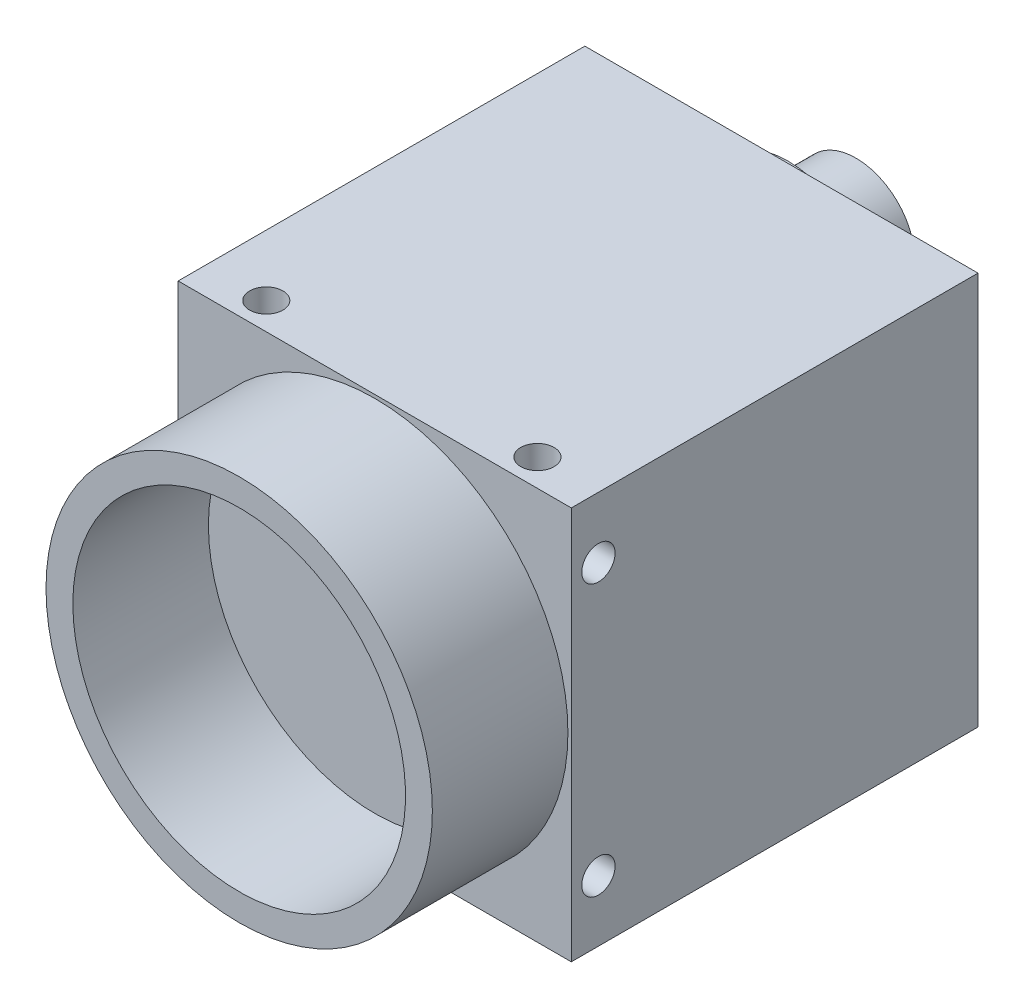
ISO-10303-21;
HEADER;
FILE_DESCRIPTION(('STEP AP214'),'2;1');
FILE_NAME('part.step','',(''),(''),'','','');
FILE_SCHEMA(('AUTOMOTIVE_DESIGN { 1 0 10303 214 1 1 1 1 }'));
ENDSEC;
DATA;
#1=APPLICATION_CONTEXT('core data for automotive mechanical design processes');
#2=APPLICATION_PROTOCOL_DEFINITION('international standard','automotive_design',2000,#1);
#3=PRODUCT_CONTEXT('',#1,'mechanical');
#4=PRODUCT('Part','Part','',(#3));
#5=PRODUCT_RELATED_PRODUCT_CATEGORY('part','',(#4));
#6=PRODUCT_DEFINITION_FORMATION('','',#4);
#7=PRODUCT_DEFINITION_CONTEXT('part definition',#1,'design');
#8=PRODUCT_DEFINITION('design','',#6,#7);
#9=PRODUCT_DEFINITION_SHAPE('','',#8);
#10=(LENGTH_UNIT() NAMED_UNIT(*) SI_UNIT(.MILLI.,.METRE.));
#11=(NAMED_UNIT(*) PLANE_ANGLE_UNIT() SI_UNIT($,.RADIAN.));
#12=(NAMED_UNIT(*) SI_UNIT($,.STERADIAN.) SOLID_ANGLE_UNIT());
#13=UNCERTAINTY_MEASURE_WITH_UNIT(LENGTH_MEASURE(1.E-05),#10,'distance_accuracy_value','');
#14=(GEOMETRIC_REPRESENTATION_CONTEXT(3) GLOBAL_UNCERTAINTY_ASSIGNED_CONTEXT((#13)) GLOBAL_UNIT_ASSIGNED_CONTEXT((#10,
#11,#12)) REPRESENTATION_CONTEXT('',''));
#15=CARTESIAN_POINT('',(0.,0.,0.));
#16=DIRECTION('',(0.,0.,1.));
#17=DIRECTION('',(1.,0.,0.));
#18=AXIS2_PLACEMENT_3D('',#15,#16,#17);
#19=CARTESIAN_POINT('',(0.,0.,30.));
#20=DIRECTION('',(0.,0.,1.));
#21=DIRECTION('',(1.,0.,0.));
#22=AXIS2_PLACEMENT_3D('',#19,#20,#21);
#23=CYLINDRICAL_SURFACE('',#22,14.25);
#24=CARTESIAN_POINT('',(0.,0.,30.));
#25=DIRECTION('',(0.,0.,1.));
#26=DIRECTION('',(1.,0.,0.));
#27=AXIS2_PLACEMENT_3D('',#24,#25,#26);
#28=CIRCLE('',#27,14.25);
#29=CARTESIAN_POINT('',(14.25,0.,30.));
#30=VERTEX_POINT('',#29);
#31=EDGE_CURVE('E11',#30,#30,#28,.T.);
#32=ORIENTED_EDGE('',*,*,#31,.T.);
#33=EDGE_LOOP('',(#32));
#34=FACE_BOUND('',#33,.T.);
#35=CARTESIAN_POINT('',(0.,0.,40.));
#36=DIRECTION('',(0.,0.,1.));
#37=DIRECTION('',(1.,0.,0.));
#38=AXIS2_PLACEMENT_3D('',#35,#36,#37);
#39=CIRCLE('',#38,14.25);
#40=CARTESIAN_POINT('',(14.25,0.,40.));
#41=VERTEX_POINT('',#40);
#42=EDGE_CURVE('E27',#41,#41,#39,.F.);
#43=ORIENTED_EDGE('',*,*,#42,.T.);
#44=EDGE_LOOP('',(#43));
#45=FACE_BOUND('',#44,.T.);
#46=ADVANCED_FACE('F17',(#34,#45),#23,.T.);
#47=CARTESIAN_POINT('',(0.,0.,30.));
#48=DIRECTION('',(0.,0.,1.));
#49=DIRECTION('',(1.,0.,0.));
#50=AXIS2_PLACEMENT_3D('',#47,#48,#49);
#51=PLANE('',#50);
#52=ORIENTED_EDGE('',*,*,#31,.F.);
#53=EDGE_LOOP('',(#52));
#54=FACE_BOUND('',#53,.T.);
#55=DIRECTION('',(0.,1.,0.));
#56=VECTOR('',#55,1.);
#57=CARTESIAN_POINT('',(-14.5,0.,30.));
#58=LINE('',#57,#56);
#59=CARTESIAN_POINT('',(-14.5,14.5,30.));
#60=VERTEX_POINT('',#59);
#61=CARTESIAN_POINT('',(-14.5,-14.5,30.));
#62=VERTEX_POINT('',#61);
#63=EDGE_CURVE('E725',#60,#62,#58,.F.);
#64=ORIENTED_EDGE('',*,*,#63,.T.);
#65=DIRECTION('',(1.,0.,0.));
#66=VECTOR('',#65,1.);
#67=CARTESIAN_POINT('',(0.,-14.5,30.));
#68=LINE('',#67,#66);
#69=CARTESIAN_POINT('',(14.5,-14.5,30.));
#70=VERTEX_POINT('',#69);
#71=EDGE_CURVE('E626',#62,#70,#68,.T.);
#72=ORIENTED_EDGE('',*,*,#71,.T.);
#73=DIRECTION('',(0.,1.,0.));
#74=VECTOR('',#73,1.);
#75=CARTESIAN_POINT('',(14.5,0.,30.));
#76=LINE('',#75,#74);
#77=CARTESIAN_POINT('',(14.5,14.5,30.));
#78=VERTEX_POINT('',#77);
#79=EDGE_CURVE('E630',#70,#78,#76,.T.);
#80=ORIENTED_EDGE('',*,*,#79,.T.);
#81=DIRECTION('',(1.,0.,0.));
#82=VECTOR('',#81,1.);
#83=CARTESIAN_POINT('',(0.,14.5,30.));
#84=LINE('',#83,#82);
#85=EDGE_CURVE('E722',#78,#60,#84,.F.);
#86=ORIENTED_EDGE('',*,*,#85,.T.);
#87=EDGE_LOOP('',(#64,#72,#80,#86));
#88=FACE_BOUND('',#87,.T.);
#89=ADVANCED_FACE('F320',(#54,#88),#51,.T.);
#90=CARTESIAN_POINT('',(0.,0.,40.));
#91=DIRECTION('',(0.,0.,-1.));
#92=DIRECTION('',(-1.,0.,0.));
#93=AXIS2_PLACEMENT_3D('',#90,#91,#92);
#94=PLANE('',#93);
#95=CARTESIAN_POINT('',(0.,0.,40.));
#96=DIRECTION('',(0.,0.,-1.));
#97=DIRECTION('',(-1.,0.,0.));
#98=AXIS2_PLACEMENT_3D('',#95,#96,#97);
#99=CIRCLE('',#98,12.27);
#100=CARTESIAN_POINT('',(-12.27,0.,40.));
#101=VERTEX_POINT('',#100);
#102=EDGE_CURVE('E627',#101,#101,#99,.F.);
#103=ORIENTED_EDGE('',*,*,#102,.F.);
#104=EDGE_LOOP('',(#103));
#105=FACE_BOUND('',#104,.T.);
#106=ORIENTED_EDGE('',*,*,#42,.F.);
#107=EDGE_LOOP('',(#106));
#108=FACE_BOUND('',#107,.T.);
#109=ADVANCED_FACE('F326',(#105,#108),#94,.F.);
#110=CARTESIAN_POINT('',(14.5,-14.5,0.));
#111=DIRECTION('',(0.,-1.,0.));
#112=DIRECTION('',(0.,0.,-1.));
#113=AXIS2_PLACEMENT_3D('',#110,#111,#112);
#114=PLANE('',#113);
#115=CARTESIAN_POINT('',(10.,-14.5,28.));
#116=DIRECTION('',(0.,-1.,0.));
#117=DIRECTION('',(1.,0.,0.));
#118=AXIS2_PLACEMENT_3D('',#115,#116,#117);
#119=CIRCLE('',#118,1.2295);
#120=CARTESIAN_POINT('',(11.2295,-14.5,28.));
#121=VERTEX_POINT('',#120);
#122=EDGE_CURVE('E631',#121,#121,#119,.F.);
#123=ORIENTED_EDGE('',*,*,#122,.T.);
#124=EDGE_LOOP('',(#123));
#125=FACE_BOUND('',#124,.T.);
#126=CARTESIAN_POINT('',(-10.,-14.5,28.));
#127=DIRECTION('',(0.,-1.,0.));
#128=DIRECTION('',(1.,0.,0.));
#129=AXIS2_PLACEMENT_3D('',#126,#127,#128);
#130=CIRCLE('',#129,1.2295);
#131=CARTESIAN_POINT('',(-8.7705,-14.5,28.));
#132=VERTEX_POINT('',#131);
#133=EDGE_CURVE('E634',#132,#132,#130,.F.);
#134=ORIENTED_EDGE('',*,*,#133,.T.);
#135=EDGE_LOOP('',(#134));
#136=FACE_BOUND('',#135,.T.);
#137=DIRECTION('',(1.,0.,0.));
#138=VECTOR('',#137,1.);
#139=CARTESIAN_POINT('',(14.5,-14.5,0.));
#140=LINE('',#139,#138);
#141=CARTESIAN_POINT('',(-14.5,-14.5,0.));
#142=VERTEX_POINT('',#141);
#143=CARTESIAN_POINT('',(14.5,-14.5,0.));
#144=VERTEX_POINT('',#143);
#145=EDGE_CURVE('E704',#142,#144,#140,.T.);
#146=ORIENTED_EDGE('',*,*,#145,.T.);
#147=DIRECTION('',(0.,0.,-1.));
#148=VECTOR('',#147,1.);
#149=CARTESIAN_POINT('',(14.5,-14.5,0.));
#150=LINE('',#149,#148);
#151=EDGE_CURVE('E637',#144,#70,#150,.F.);
#152=ORIENTED_EDGE('',*,*,#151,.T.);
#153=ORIENTED_EDGE('',*,*,#71,.F.);
#154=DIRECTION('',(0.,0.,-1.));
#155=VECTOR('',#154,1.);
#156=CARTESIAN_POINT('',(-14.5,-14.5,0.));
#157=LINE('',#156,#155);
#158=EDGE_CURVE('E36',#62,#142,#157,.T.);
#159=ORIENTED_EDGE('',*,*,#158,.T.);
#160=EDGE_LOOP('',(#146,#152,#153,#159));
#161=FACE_BOUND('',#160,.T.);
#162=ADVANCED_FACE('F333',(#125,#136,#161),#114,.T.);
#163=CARTESIAN_POINT('',(-14.5,-14.5,0.));
#164=DIRECTION('',(-1.,0.,0.));
#165=DIRECTION('',(0.,0.,1.));
#166=AXIS2_PLACEMENT_3D('',#163,#164,#165);
#167=PLANE('',#166);
#168=CARTESIAN_POINT('',(-14.5,10.,28.));
#169=DIRECTION('',(-1.,0.,0.));
#170=DIRECTION('',(0.,-1.,0.));
#171=AXIS2_PLACEMENT_3D('',#168,#169,#170);
#172=CIRCLE('',#171,1.2295);
#173=CARTESIAN_POINT('',(-14.5,8.7705,28.));
#174=VERTEX_POINT('',#173);
#175=EDGE_CURVE('E638',#174,#174,#172,.F.);
#176=ORIENTED_EDGE('',*,*,#175,.T.);
#177=EDGE_LOOP('',(#176));
#178=FACE_BOUND('',#177,.T.);
#179=CARTESIAN_POINT('',(-14.5,-10.,28.));
#180=DIRECTION('',(-1.,0.,0.));
#181=DIRECTION('',(0.,-1.,0.));
#182=AXIS2_PLACEMENT_3D('',#179,#180,#181);
#183=CIRCLE('',#182,1.2295);
#184=CARTESIAN_POINT('',(-14.5,-11.2295,28.));
#185=VERTEX_POINT('',#184);
#186=EDGE_CURVE('E641',#185,#185,#183,.F.);
#187=ORIENTED_EDGE('',*,*,#186,.T.);
#188=EDGE_LOOP('',(#187));
#189=FACE_BOUND('',#188,.T.);
#190=DIRECTION('',(0.,1.,0.));
#191=VECTOR('',#190,1.);
#192=CARTESIAN_POINT('',(-14.5,-14.5,0.));
#193=LINE('',#192,#191);
#194=CARTESIAN_POINT('',(-14.5,14.5,0.));
#195=VERTEX_POINT('',#194);
#196=EDGE_CURVE('E644',#195,#142,#193,.F.);
#197=ORIENTED_EDGE('',*,*,#196,.T.);
#198=ORIENTED_EDGE('',*,*,#158,.F.);
#199=ORIENTED_EDGE('',*,*,#63,.F.);
#200=DIRECTION('',(0.,0.,1.));
#201=VECTOR('',#200,1.);
#202=CARTESIAN_POINT('',(-14.5,14.5,0.));
#203=LINE('',#202,#201);
#204=EDGE_CURVE('E648',#60,#195,#203,.F.);
#205=ORIENTED_EDGE('',*,*,#204,.T.);
#206=EDGE_LOOP('',(#197,#198,#199,#205));
#207=FACE_BOUND('',#206,.T.);
#208=ADVANCED_FACE('F337',(#178,#189,#207),#167,.T.);
#209=CARTESIAN_POINT('',(-14.5,14.5,0.));
#210=DIRECTION('',(0.,1.,0.));
#211=DIRECTION('',(0.,0.,1.));
#212=AXIS2_PLACEMENT_3D('',#209,#210,#211);
#213=PLANE('',#212);
#214=CARTESIAN_POINT('',(-10.,14.5,28.));
#215=DIRECTION('',(0.,1.,0.));
#216=DIRECTION('',(-1.,0.,0.));
#217=AXIS2_PLACEMENT_3D('',#214,#215,#216);
#218=CIRCLE('',#217,1.2295);
#219=CARTESIAN_POINT('',(-11.2295,14.5,28.));
#220=VERTEX_POINT('',#219);
#221=EDGE_CURVE('E645',#220,#220,#218,.F.);
#222=ORIENTED_EDGE('',*,*,#221,.T.);
#223=EDGE_LOOP('',(#222));
#224=FACE_BOUND('',#223,.T.);
#225=CARTESIAN_POINT('',(10.,14.5,28.));
#226=DIRECTION('',(0.,1.,0.));
#227=DIRECTION('',(-1.,0.,0.));
#228=AXIS2_PLACEMENT_3D('',#225,#226,#227);
#229=CIRCLE('',#228,1.2295);
#230=CARTESIAN_POINT('',(8.7705,14.5,28.));
#231=VERTEX_POINT('',#230);
#232=EDGE_CURVE('E649',#231,#231,#229,.F.);
#233=ORIENTED_EDGE('',*,*,#232,.T.);
#234=EDGE_LOOP('',(#233));
#235=FACE_BOUND('',#234,.T.);
#236=DIRECTION('',(1.,0.,0.));
#237=VECTOR('',#236,1.);
#238=CARTESIAN_POINT('',(-14.5,14.5,0.));
#239=LINE('',#238,#237);
#240=CARTESIAN_POINT('',(14.5,14.5,0.));
#241=VERTEX_POINT('',#240);
#242=EDGE_CURVE('E652',#241,#195,#239,.F.);
#243=ORIENTED_EDGE('',*,*,#242,.T.);
#244=ORIENTED_EDGE('',*,*,#204,.F.);
#245=ORIENTED_EDGE('',*,*,#85,.F.);
#246=DIRECTION('',(0.,0.,1.));
#247=VECTOR('',#246,1.);
#248=CARTESIAN_POINT('',(14.5,14.5,0.));
#249=LINE('',#248,#247);
#250=EDGE_CURVE('E656',#78,#241,#249,.F.);
#251=ORIENTED_EDGE('',*,*,#250,.T.);
#252=EDGE_LOOP('',(#243,#244,#245,#251));
#253=FACE_BOUND('',#252,.T.);
#254=ADVANCED_FACE('F341',(#224,#235,#253),#213,.T.);
#255=CARTESIAN_POINT('',(14.5,14.5,0.));
#256=DIRECTION('',(1.,0.,0.));
#257=DIRECTION('',(0.,0.,-1.));
#258=AXIS2_PLACEMENT_3D('',#255,#256,#257);
#259=PLANE('',#258);
#260=CARTESIAN_POINT('',(14.5,10.,28.));
#261=DIRECTION('',(1.,0.,0.));
#262=DIRECTION('',(0.,0.,-1.));
#263=AXIS2_PLACEMENT_3D('',#260,#261,#262);
#264=CIRCLE('',#263,1.2295);
#265=CARTESIAN_POINT('',(14.5,10.,26.7705));
#266=VERTEX_POINT('',#265);
#267=EDGE_CURVE('E653',#266,#266,#264,.F.);
#268=ORIENTED_EDGE('',*,*,#267,.T.);
#269=EDGE_LOOP('',(#268));
#270=FACE_BOUND('',#269,.T.);
#271=CARTESIAN_POINT('',(14.5,-10.,28.));
#272=DIRECTION('',(1.,0.,0.));
#273=DIRECTION('',(0.,0.,-1.));
#274=AXIS2_PLACEMENT_3D('',#271,#272,#273);
#275=CIRCLE('',#274,1.2295);
#276=CARTESIAN_POINT('',(14.5,-10.,26.7705));
#277=VERTEX_POINT('',#276);
#278=EDGE_CURVE('E657',#277,#277,#275,.F.);
#279=ORIENTED_EDGE('',*,*,#278,.T.);
#280=EDGE_LOOP('',(#279));
#281=FACE_BOUND('',#280,.T.);
#282=DIRECTION('',(0.,1.,0.));
#283=VECTOR('',#282,1.);
#284=CARTESIAN_POINT('',(14.5,14.5,0.));
#285=LINE('',#284,#283);
#286=EDGE_CURVE('E659',#144,#241,#285,.T.);
#287=ORIENTED_EDGE('',*,*,#286,.T.);
#288=ORIENTED_EDGE('',*,*,#250,.F.);
#289=ORIENTED_EDGE('',*,*,#79,.F.);
#290=ORIENTED_EDGE('',*,*,#151,.F.);
#291=EDGE_LOOP('',(#287,#288,#289,#290));
#292=FACE_BOUND('',#291,.T.);
#293=ADVANCED_FACE('F345',(#270,#281,#292),#259,.T.);
#294=CARTESIAN_POINT('',(0.,0.,40.));
#295=DIRECTION('',(0.,0.,-1.));
#296=DIRECTION('',(-1.,0.,0.));
#297=AXIS2_PLACEMENT_3D('',#294,#295,#296);
#298=CYLINDRICAL_SURFACE('',#297,12.27);
#299=CARTESIAN_POINT('',(0.,0.,30.));
#300=DIRECTION('',(0.,0.,-1.));
#301=DIRECTION('',(-1.,0.,0.));
#302=AXIS2_PLACEMENT_3D('',#299,#300,#301);
#303=CIRCLE('',#302,12.27);
#304=CARTESIAN_POINT('',(-12.27,0.,30.));
#305=VERTEX_POINT('',#304);
#306=EDGE_CURVE('E660',#305,#305,#303,.F.);
#307=ORIENTED_EDGE('',*,*,#306,.F.);
#308=EDGE_LOOP('',(#307));
#309=FACE_BOUND('',#308,.T.);
#310=ORIENTED_EDGE('',*,*,#102,.T.);
#311=EDGE_LOOP('',(#310));
#312=FACE_BOUND('',#311,.T.);
#313=ADVANCED_FACE('F349',(#309,#312),#298,.F.);
#314=CARTESIAN_POINT('',(10.,-12.,28.));
#315=DIRECTION('',(0.,-1.,0.));
#316=DIRECTION('',(1.,0.,0.));
#317=AXIS2_PLACEMENT_3D('',#314,#315,#316);
#318=CYLINDRICAL_SURFACE('',#317,1.2295);
#319=CARTESIAN_POINT('',(10.,-9.5,28.));
#320=DIRECTION('',(0.,-1.,0.));
#321=DIRECTION('',(1.,0.,0.));
#322=AXIS2_PLACEMENT_3D('',#319,#320,#321);
#323=CIRCLE('',#322,1.2295);
#324=CARTESIAN_POINT('',(9.50000000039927,-9.5000000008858,29.1232409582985));
#325=VERTEX_POINT('',#324);
#326=CARTESIAN_POINT('',(9.5000000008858,-9.50000000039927,26.8767590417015));
#327=VERTEX_POINT('',#326);
#328=EDGE_CURVE('E380',#325,#327,#323,.T.);
#329=ORIENTED_EDGE('',*,*,#328,.F.);
#330=CARTESIAN_POINT('',(9.5000000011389,-10.4999999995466,29.1232409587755));
#331=CARTESIAN_POINT('',(9.48792006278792,-10.4625637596,29.1178756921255));
#332=CARTESIAN_POINT('',(9.47652389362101,-10.424852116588,29.1125566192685));
#333=CARTESIAN_POINT('',(9.45571666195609,-10.3485957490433,29.1025214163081));
#334=CARTESIAN_POINT('',(9.44631642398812,-10.3100476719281,29.0978086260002));
#335=CARTESIAN_POINT('',(9.43040429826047,-10.2329260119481,29.089638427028));
#336=CARTESIAN_POINT('',(9.42384379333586,-10.1943651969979,29.0861600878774));
#337=CARTESIAN_POINT('',(9.41412103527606,-10.116766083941,29.0809474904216));
#338=CARTESIAN_POINT('',(9.41095110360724,-10.0777290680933,29.0792092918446));
#339=CARTESIAN_POINT('',(9.40842168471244,-9.99862268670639,29.0778258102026));
#340=CARTESIAN_POINT('',(9.40914770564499,-9.95854952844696,29.0782274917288));
#341=CARTESIAN_POINT('',(9.41449319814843,-9.87871420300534,29.0811382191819));
#342=CARTESIAN_POINT('',(9.41911711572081,-9.83895244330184,29.083649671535));
#343=CARTESIAN_POINT('',(9.43161539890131,-9.7600659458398,29.0902558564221));
#344=CARTESIAN_POINT('',(9.43949297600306,-9.72094187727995,29.094352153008));
#345=CARTESIAN_POINT('',(9.45771031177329,-9.64341179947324,29.1034923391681));
#346=CARTESIAN_POINT('',(9.46804953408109,-9.6050056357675,29.1085360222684));
#347=CARTESIAN_POINT('',(9.48259794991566,-9.55569134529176,29.115338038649));
#348=CARTESIAN_POINT('',(9.48598401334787,-9.54450469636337,29.1169030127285));
#349=CARTESIAN_POINT('',(9.49289186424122,-9.52220486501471,29.1200562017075));
#350=CARTESIAN_POINT('',(9.49641332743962,-9.51109157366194,29.121644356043));
#351=CARTESIAN_POINT('',(9.50000000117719,-9.50000000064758,29.1232409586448));
#352=B_SPLINE_CURVE_WITH_KNOTS('',3,(#330,#331,#332,#333,#334,#335,#336,#337,#338,#339,#340,
#341,#342,#343,#344,#345,#346,#347,#348,#349,#350,#351),.UNSPECIFIED.,.F.,.F.,(4,2,2,2,2,2,2,2,
2,2,4),(0.,0.119167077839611,0.238964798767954,0.35662153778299,0.474011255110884,
0.593987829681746,0.71410143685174,0.834333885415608,0.954540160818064,0.9899164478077,
1.0252127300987),.UNSPECIFIED.);
#353=CARTESIAN_POINT('',(9.50000000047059,-10.4999999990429,29.1232409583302));
#354=VERTEX_POINT('',#353);
#355=EDGE_CURVE('E372',#354,#325,#352,.T.);
#356=ORIENTED_EDGE('',*,*,#355,.F.);
#357=CARTESIAN_POINT('',(10.,-10.,28.));
#358=DIRECTION('',(0.707106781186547,-0.707106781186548,0.));
#359=DIRECTION('',(0.707106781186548,0.707106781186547,0.));
#360=AXIS2_PLACEMENT_3D('',#357,#358,#359);
#361=ELLIPSE('',#360,1.73877557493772,1.2295);
#362=CARTESIAN_POINT('',(10.,-10.,29.2295));
#363=VERTEX_POINT('',#362);
#364=EDGE_CURVE('E381',#363,#354,#361,.T.);
#365=ORIENTED_EDGE('',*,*,#364,.F.);
#366=CARTESIAN_POINT('',(10.,-10.,28.));
#367=DIRECTION('',(0.707106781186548,0.707106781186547,0.));
#368=DIRECTION('',(0.707106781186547,-0.707106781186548,0.));
#369=AXIS2_PLACEMENT_3D('',#366,#367,#368);
#370=ELLIPSE('',#369,1.73877557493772,1.2295);
#371=CARTESIAN_POINT('',(10.,-10.,26.7705));
#372=VERTEX_POINT('',#371);
#373=EDGE_CURVE('E1186',#372,#363,#370,.F.);
#374=ORIENTED_EDGE('',*,*,#373,.F.);
#375=CARTESIAN_POINT('',(10.,-10.,28.));
#376=DIRECTION('',(0.707106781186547,-0.707106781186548,0.));
#377=DIRECTION('',(0.707106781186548,0.707106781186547,0.));
#378=AXIS2_PLACEMENT_3D('',#375,#376,#377);
#379=ELLIPSE('',#378,1.73877557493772,1.2295);
#380=CARTESIAN_POINT('',(9.50000000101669,-10.4999999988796,26.8767590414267));
#381=VERTEX_POINT('',#380);
#382=EDGE_CURVE('E416',#381,#372,#379,.T.);
#383=ORIENTED_EDGE('',*,*,#382,.F.);
#384=CARTESIAN_POINT('',(9.50000000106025,-9.50000000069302,26.8767590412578));
#385=CARTESIAN_POINT('',(9.48792006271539,-9.53743624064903,26.8821243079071));
#386=CARTESIAN_POINT('',(9.47652389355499,-9.57514788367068,26.8874433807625));
#387=CARTESIAN_POINT('',(9.45571666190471,-9.6514042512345,26.8974785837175));
#388=CARTESIAN_POINT('',(9.44631642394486,-9.68995232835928,26.9021913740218));
#389=CARTESIAN_POINT('',(9.43040429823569,-9.76707398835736,26.910361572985));
#390=CARTESIAN_POINT('',(9.42384379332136,-9.80563480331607,26.9138399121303));
#391=CARTESIAN_POINT('',(9.41412103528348,-9.88323391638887,26.9190525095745));
#392=CARTESIAN_POINT('',(9.41095110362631,-9.92227093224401,26.920790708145));
#393=CARTESIAN_POINT('',(9.40842168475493,-10.0013773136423,26.9221741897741));
#394=CARTESIAN_POINT('',(9.40914770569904,-10.0414504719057,26.9217725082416));
#395=CARTESIAN_POINT('',(9.41449319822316,-10.1212857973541,26.9188617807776));
#396=CARTESIAN_POINT('',(9.41911711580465,-10.1610475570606,26.91635032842));
#397=CARTESIAN_POINT('',(9.4316153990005,-10.2399340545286,26.9097441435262));
#398=CARTESIAN_POINT('',(9.4394929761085,-10.2790581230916,26.9056478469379));
#399=CARTESIAN_POINT('',(9.45771031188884,-10.356588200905,26.8965076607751));
#400=CARTESIAN_POINT('',(9.4680495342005,-10.3949943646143,26.8914639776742));
#401=CARTESIAN_POINT('',(9.48259795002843,-10.4443086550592,26.8846619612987));
#402=CARTESIAN_POINT('',(9.4859840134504,-10.4554953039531,26.8830969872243));
#403=CARTESIAN_POINT('',(9.49289186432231,-10.4777951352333,26.8799437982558));
#404=CARTESIAN_POINT('',(9.4964133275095,-10.4889084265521,26.8783556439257));
#405=CARTESIAN_POINT('',(9.50000000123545,-10.4999999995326,26.8767590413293));
#406=B_SPLINE_CURVE_WITH_KNOTS('',3,(#384,#385,#386,#387,#388,#389,#390,#391,#392,#393,#394,
#395,#396,#397,#398,#399,#400,#401,#402,#403,#404,#405),.UNSPECIFIED.,.F.,.F.,(4,2,2,2,2,2,2,2,
2,2,4),(0.,0.119167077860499,0.238964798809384,0.356621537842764,0.474011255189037,
0.593987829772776,0.714101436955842,0.834333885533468,0.954540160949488,0.989916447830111,
1.02521273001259),.UNSPECIFIED.);
#407=EDGE_CURVE('E364',#327,#381,#406,.T.);
#408=ORIENTED_EDGE('',*,*,#407,.F.);
#409=EDGE_LOOP('',(#329,#356,#365,#374,#383,#408));
#410=FACE_BOUND('',#409,.T.);
#411=ORIENTED_EDGE('',*,*,#122,.F.);
#412=EDGE_LOOP('',(#411));
#413=FACE_BOUND('',#412,.T.);
#414=ADVANCED_FACE('F353',(#410,#413),#318,.F.);
#415=CARTESIAN_POINT('',(-10.,-12.,28.));
#416=DIRECTION('',(0.,-1.,0.));
#417=DIRECTION('',(1.,0.,0.));
#418=AXIS2_PLACEMENT_3D('',#415,#416,#417);
#419=CYLINDRICAL_SURFACE('',#418,1.2295);
#420=ORIENTED_EDGE('',*,*,#133,.F.);
#421=EDGE_LOOP('',(#420));
#422=FACE_BOUND('',#421,.T.);
#423=CARTESIAN_POINT('',(-10.,-9.5,28.));
#424=DIRECTION('',(0.,-1.,0.));
#425=DIRECTION('',(1.,0.,0.));
#426=AXIS2_PLACEMENT_3D('',#423,#424,#425);
#427=CIRCLE('',#426,1.2295);
#428=CARTESIAN_POINT('',(-9.50000000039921,-9.50000000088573,26.8767590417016));
#429=VERTEX_POINT('',#428);
#430=CARTESIAN_POINT('',(-9.50000000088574,-9.5000000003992,29.1232409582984));
#431=VERTEX_POINT('',#430);
#432=EDGE_CURVE('E417',#429,#431,#427,.T.);
#433=ORIENTED_EDGE('',*,*,#432,.F.);
#434=CARTESIAN_POINT('',(-9.50000000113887,-10.4999999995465,26.8767590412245));
#435=CARTESIAN_POINT('',(-9.48792006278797,-10.4625637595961,26.8821243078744));
#436=CARTESIAN_POINT('',(-9.47652389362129,-10.4248521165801,26.8874433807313));
#437=CARTESIAN_POINT('',(-9.45571666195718,-10.3485957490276,26.8974785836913));
#438=CARTESIAN_POINT('',(-9.4463164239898,-10.3100476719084,26.902191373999));
#439=CARTESIAN_POINT('',(-9.43040429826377,-10.2329260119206,26.9103615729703));
#440=CARTESIAN_POINT('',(-9.42384379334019,-10.1943651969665,26.9138399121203));
#441=CARTESIAN_POINT('',(-9.41412103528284,-10.116766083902,26.9190525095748));
#442=CARTESIAN_POINT('',(-9.41095110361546,-10.0777290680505,26.9207907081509));
#443=CARTESIAN_POINT('',(-9.40842168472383,-9.99862268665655,26.9221741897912));
#444=CARTESIAN_POINT('',(-9.40914770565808,-9.95854952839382,26.9217725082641));
#445=CARTESIAN_POINT('',(-9.41449319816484,-9.87871420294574,26.9188617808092));
#446=CARTESIAN_POINT('',(-9.41911711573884,-9.8389524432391,26.9163503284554));
#447=CARTESIAN_POINT('',(-9.43161539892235,-9.76006594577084,26.909744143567));
#448=CARTESIAN_POINT('',(-9.4394929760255,-9.72094187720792,26.9056478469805));
#449=CARTESIAN_POINT('',(-9.45771031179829,-9.64341179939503,26.8965076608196));
#450=CARTESIAN_POINT('',(-9.46804953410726,-9.60500563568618,26.891463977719));
#451=CARTESIAN_POINT('',(-9.48259794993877,-9.55569134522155,26.8846619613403));
#452=CARTESIAN_POINT('',(-9.48598401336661,-9.54450469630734,26.8830969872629));
#453=CARTESIAN_POINT('',(-9.49289186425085,-9.52220486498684,26.8799437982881));
#454=CARTESIAN_POINT('',(-9.4964133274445,-9.51109157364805,26.8783556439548));
#455=CARTESIAN_POINT('',(-9.50000000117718,-9.5000000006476,26.8767590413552));
#456=B_SPLINE_CURVE_WITH_KNOTS('',3,(#434,#435,#436,#437,#438,#439,#440,#441,#442,#443,#444,
#445,#446,#447,#448,#449,#450,#451,#452,#453,#454,#455),.UNSPECIFIED.,.F.,.F.,(4,2,2,2,2,2,2,2,
2,2,4),(0.,0.119167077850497,0.238964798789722,0.356621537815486,0.474011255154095,
0.593987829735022,0.714101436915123,0.834333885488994,0.954540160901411,0.989916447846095,
1.02521273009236),.UNSPECIFIED.);
#457=CARTESIAN_POINT('',(-9.50000000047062,-10.4999999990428,26.8767590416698));
#458=VERTEX_POINT('',#457);
#459=EDGE_CURVE('E418',#458,#429,#456,.T.);
#460=ORIENTED_EDGE('',*,*,#459,.F.);
#461=CARTESIAN_POINT('',(-10.,-10.,28.));
#462=DIRECTION('',(-0.707106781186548,-0.707106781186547,0.));
#463=DIRECTION('',(-0.707106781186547,0.707106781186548,0.));
#464=AXIS2_PLACEMENT_3D('',#461,#462,#463);
#465=ELLIPSE('',#464,1.73877557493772,1.2295);
#466=CARTESIAN_POINT('',(-10.,-10.,26.7705));
#467=VERTEX_POINT('',#466);
#468=EDGE_CURVE('E425',#467,#458,#465,.T.);
#469=ORIENTED_EDGE('',*,*,#468,.F.);
#470=CARTESIAN_POINT('',(-10.,-10.,28.));
#471=DIRECTION('',(-0.707106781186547,0.707106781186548,0.));
#472=DIRECTION('',(-0.707106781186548,-0.707106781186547,0.));
#473=AXIS2_PLACEMENT_3D('',#470,#471,#472);
#474=ELLIPSE('',#473,1.73877557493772,1.2295);
#475=CARTESIAN_POINT('',(-10.,-10.,29.2295));
#476=VERTEX_POINT('',#475);
#477=EDGE_CURVE('E691',#476,#467,#474,.F.);
#478=ORIENTED_EDGE('',*,*,#477,.F.);
#479=CARTESIAN_POINT('',(-10.,-10.,28.));
#480=DIRECTION('',(-0.707106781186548,-0.707106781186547,0.));
#481=DIRECTION('',(-0.707106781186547,0.707106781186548,0.));
#482=AXIS2_PLACEMENT_3D('',#479,#480,#481);
#483=ELLIPSE('',#482,1.73877557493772,1.2295);
#484=CARTESIAN_POINT('',(-9.50000000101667,-10.4999999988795,29.1232409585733));
#485=VERTEX_POINT('',#484);
#486=EDGE_CURVE('E688',#485,#476,#483,.T.);
#487=ORIENTED_EDGE('',*,*,#486,.F.);
#488=CARTESIAN_POINT('',(-9.50000000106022,-9.50000000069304,29.1232409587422));
#489=CARTESIAN_POINT('',(-9.48792006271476,-9.537436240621,29.1178756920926));
#490=CARTESIAN_POINT('',(-9.47652389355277,-9.57514788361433,29.1125566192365));
#491=CARTESIAN_POINT('',(-9.45571666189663,-9.65140425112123,29.1025214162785));
#492=CARTESIAN_POINT('',(-9.44631642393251,-9.68995232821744,29.0978086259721));
#493=CARTESIAN_POINT('',(-9.43040429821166,-9.76707398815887,29.0896384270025));
#494=CARTESIAN_POINT('',(-9.42384379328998,-9.80563480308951,29.0861600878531));
#495=CARTESIAN_POINT('',(-9.41412103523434,-9.88323391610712,29.0809474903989));
#496=CARTESIAN_POINT('',(-9.41095110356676,-9.92227093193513,29.0792092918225));
#497=CARTESIAN_POINT('',(-9.40842168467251,-10.0013773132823,29.0778258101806));
#498=CARTESIAN_POINT('',(-9.40914770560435,-10.0414504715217,29.0782274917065));
#499=CARTESIAN_POINT('',(-9.41449319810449,-10.1212857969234,29.0811382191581));
#500=CARTESIAN_POINT('',(-9.41911711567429,-10.1610475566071,29.08364967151));
#501=CARTESIAN_POINT('',(-9.43161539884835,-10.2399340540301,29.0902558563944));
#502=CARTESIAN_POINT('',(-9.43949297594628,-10.2790581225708,29.0943521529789));
#503=CARTESIAN_POINT('',(-9.45771031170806,-10.3565882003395,29.103492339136));
#504=CARTESIAN_POINT('',(-9.46804953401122,-10.3949943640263,29.1085360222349));
#505=CARTESIAN_POINT('',(-9.48259794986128,-10.4443086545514,29.1153380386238));
#506=CARTESIAN_POINT('',(-9.48598401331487,-10.4554953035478,29.1169030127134));
#507=CARTESIAN_POINT('',(-9.49289186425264,-10.4777951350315,29.1200562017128));
#508=CARTESIAN_POINT('',(-9.49641332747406,-10.4889084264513,29.1216443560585));
#509=CARTESIAN_POINT('',(-9.50000000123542,-10.4999999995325,29.1232409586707));
#510=B_SPLINE_CURVE_WITH_KNOTS('',3,(#488,#489,#490,#491,#492,#493,#494,#495,#496,#497,#498,
#499,#500,#501,#502,#503,#504,#505,#506,#507,#508,#509),.UNSPECIFIED.,.F.,.F.,(4,2,2,2,2,2,2,2,
2,2,4),(0.,0.119167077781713,0.238964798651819,0.356621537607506,0.474011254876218,
0.593987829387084,0.714101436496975,0.834333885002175,0.954540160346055,0.989916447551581,
1.02521273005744),.UNSPECIFIED.);
#511=EDGE_CURVE('E408',#431,#485,#510,.T.);
#512=ORIENTED_EDGE('',*,*,#511,.F.);
#513=EDGE_LOOP('',(#433,#460,#469,#478,#487,#512));
#514=FACE_BOUND('',#513,.T.);
#515=ADVANCED_FACE('F358',(#422,#514),#419,.F.);
#516=CARTESIAN_POINT('',(0.,0.,0.));
#517=DIRECTION('',(0.,0.,1.));
#518=DIRECTION('',(1.,0.,0.));
#519=AXIS2_PLACEMENT_3D('',#516,#517,#518);
#520=PLANE('',#519);
#521=CARTESIAN_POINT('',(0.,7.5,0.));
#522=DIRECTION('',(0.,0.,-1.));
#523=DIRECTION('',(-1.,0.,0.));
#524=AXIS2_PLACEMENT_3D('',#521,#522,#523);
#525=CIRCLE('',#524,6.65);
#526=CARTESIAN_POINT('',(-6.65,7.5,0.));
#527=VERTEX_POINT('',#526);
#528=EDGE_CURVE('E462',#527,#527,#525,.T.);
#529=ORIENTED_EDGE('',*,*,#528,.F.);
#530=EDGE_LOOP('',(#529));
#531=FACE_BOUND('',#530,.T.);
#532=ORIENTED_EDGE('',*,*,#286,.F.);
#533=ORIENTED_EDGE('',*,*,#145,.F.);
#534=ORIENTED_EDGE('',*,*,#196,.F.);
#535=ORIENTED_EDGE('',*,*,#242,.F.);
#536=EDGE_LOOP('',(#532,#533,#534,#535));
#537=FACE_BOUND('',#536,.T.);
#538=ADVANCED_FACE('F475',(#531,#537),#520,.F.);
#539=CARTESIAN_POINT('',(-12.,10.,28.));
#540=DIRECTION('',(-1.,0.,0.));
#541=DIRECTION('',(0.,-1.,0.));
#542=AXIS2_PLACEMENT_3D('',#539,#540,#541);
#543=CYLINDRICAL_SURFACE('',#542,1.2295);
#544=ORIENTED_EDGE('',*,*,#175,.F.);
#545=EDGE_LOOP('',(#544));
#546=FACE_BOUND('',#545,.T.);
#547=CARTESIAN_POINT('',(-9.5,10.,28.));
#548=DIRECTION('',(-1.,0.,0.));
#549=DIRECTION('',(0.,-1.,0.));
#550=AXIS2_PLACEMENT_3D('',#547,#548,#549);
#551=CIRCLE('',#550,1.2295);
#552=CARTESIAN_POINT('',(-9.5000000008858,9.50000000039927,26.8767590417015));
#553=VERTEX_POINT('',#552);
#554=CARTESIAN_POINT('',(-9.50000000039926,9.5000000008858,29.1232409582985));
#555=VERTEX_POINT('',#554);
#556=EDGE_CURVE('E463',#553,#555,#551,.T.);
#557=ORIENTED_EDGE('',*,*,#556,.F.);
#558=CARTESIAN_POINT('',(-10.4999999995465,9.50000000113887,26.8767590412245));
#559=CARTESIAN_POINT('',(-10.4625637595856,9.4879200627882,26.8821243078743));
#560=CARTESIAN_POINT('',(-10.4248521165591,9.47652389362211,26.887443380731));
#561=CARTESIAN_POINT('',(-10.3485957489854,9.45571666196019,26.8974785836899));
#562=CARTESIAN_POINT('',(-10.3100476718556,9.4463164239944,26.9021913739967));
#563=CARTESIAN_POINT('',(-10.2329260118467,9.43040429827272,26.9103615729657));
#564=CARTESIAN_POINT('',(-10.1943651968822,9.42384379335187,26.9138399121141));
#565=CARTESIAN_POINT('',(-10.1167660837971,9.41412103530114,26.9190525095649));
#566=CARTESIAN_POINT('',(-10.0777290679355,9.41095110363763,26.9207907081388));
#567=CARTESIAN_POINT('',(-9.99862268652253,9.4084216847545,26.9221741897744));
#568=CARTESIAN_POINT('',(-9.95854952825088,9.40914770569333,26.9217725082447));
#569=CARTESIAN_POINT('',(-9.87871420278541,9.41449319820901,26.9188617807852));
#570=CARTESIAN_POINT('',(-9.83895244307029,9.41911711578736,26.9163503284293));
#571=CARTESIAN_POINT('',(-9.76006594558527,9.43161539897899,26.9097441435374));
#572=CARTESIAN_POINT('',(-9.72094187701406,9.43949297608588,26.9056478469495));
#573=CARTESIAN_POINT('',(-9.64341179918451,9.45771031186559,26.8965076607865));
#574=CARTESIAN_POINT('',(-9.60500563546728,9.46804953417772,26.8914639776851));
#575=CARTESIAN_POINT('',(-9.55569134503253,9.48259795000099,26.8846619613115));
#576=CARTESIAN_POINT('',(-9.54450469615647,9.48598401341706,26.8830969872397));
#577=CARTESIAN_POINT('',(-9.52220486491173,9.49289186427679,26.8799437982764));
#578=CARTESIAN_POINT('',(-9.51109157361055,9.4964133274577,26.878355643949));
#579=CARTESIAN_POINT('',(-9.50000000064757,9.50000000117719,26.8767590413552));
#580=B_SPLINE_CURVE_WITH_KNOTS('',3,(#558,#559,#560,#561,#562,#563,#564,#565,#566,#567,#568,
#569,#570,#571,#572,#573,#574,#575,#576,#577,#578,#579),.UNSPECIFIED.,.F.,.F.,(4,2,2,2,2,2,2,2,
2,2,4),(0.,0.119167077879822,0.238964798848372,0.35662153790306,0.474011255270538,
0.593987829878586,0.714101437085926,0.834333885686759,0.954540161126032,0.989916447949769,
1.02521273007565),.UNSPECIFIED.);
#581=CARTESIAN_POINT('',(-10.4999999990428,9.50000000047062,26.8767590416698));
#582=VERTEX_POINT('',#581);
#583=EDGE_CURVE('E465',#582,#553,#580,.T.);
#584=ORIENTED_EDGE('',*,*,#583,.F.);
#585=CARTESIAN_POINT('',(-10.,10.,28.));
#586=DIRECTION('',(-0.707106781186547,0.707106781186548,0.));
#587=DIRECTION('',(0.707106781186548,0.707106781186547,0.));
#588=AXIS2_PLACEMENT_3D('',#585,#586,#587);
#589=ELLIPSE('',#588,1.73877557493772,1.2295);
#590=CARTESIAN_POINT('',(-10.,10.,26.7705));
#591=VERTEX_POINT('',#590);
#592=EDGE_CURVE('E1253',#591,#582,#589,.T.);
#593=ORIENTED_EDGE('',*,*,#592,.F.);
#594=CARTESIAN_POINT('',(-10.,10.,28.));
#595=DIRECTION('',(0.707106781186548,0.707106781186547,0.));
#596=DIRECTION('',(-0.707106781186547,0.707106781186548,0.));
#597=AXIS2_PLACEMENT_3D('',#594,#595,#596);
#598=ELLIPSE('',#597,1.73877557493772,1.2295);
#599=CARTESIAN_POINT('',(-10.,10.,29.2295));
#600=VERTEX_POINT('',#599);
#601=EDGE_CURVE('E1251',#600,#591,#598,.F.);
#602=ORIENTED_EDGE('',*,*,#601,.F.);
#603=CARTESIAN_POINT('',(-10.,10.,28.));
#604=DIRECTION('',(-0.707106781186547,0.707106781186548,0.));
#605=DIRECTION('',(0.707106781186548,0.707106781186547,0.));
#606=AXIS2_PLACEMENT_3D('',#603,#604,#605);
#607=ELLIPSE('',#606,1.73877557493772,1.2295);
#608=CARTESIAN_POINT('',(-10.4999999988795,9.50000000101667,29.1232409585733));
#609=VERTEX_POINT('',#608);
#610=EDGE_CURVE('E1250',#609,#600,#607,.T.);
#611=ORIENTED_EDGE('',*,*,#610,.F.);
#612=CARTESIAN_POINT('',(-9.50000000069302,9.50000000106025,29.1232409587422));
#613=CARTESIAN_POINT('',(-9.53743624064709,9.48792006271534,29.1178756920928));
#614=CARTESIAN_POINT('',(-9.5751478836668,9.47652389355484,29.1125566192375));
#615=CARTESIAN_POINT('',(-9.6514042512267,9.45571666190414,29.1025214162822));
#616=CARTESIAN_POINT('',(-9.68995232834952,9.44631642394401,29.0978086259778));
#617=CARTESIAN_POINT('',(-9.7670739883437,9.43040429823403,29.0896384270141));
#618=CARTESIAN_POINT('',(-9.80563480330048,9.42384379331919,29.0861600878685));
#619=CARTESIAN_POINT('',(-9.88323391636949,9.41412103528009,29.0809474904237));
#620=CARTESIAN_POINT('',(-9.92227093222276,9.41095110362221,29.0792092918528));
#621=CARTESIAN_POINT('',(-10.0013773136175,9.40842168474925,29.0778258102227));
#622=CARTESIAN_POINT('',(-10.0414504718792,9.40914770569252,29.0782274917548));
#623=CARTESIAN_POINT('',(-10.1212857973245,9.41449319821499,29.081138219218));
#624=CARTESIAN_POINT('',(-10.1610475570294,9.41911711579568,29.0836496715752));
#625=CARTESIAN_POINT('',(-10.2399340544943,9.43161539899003,29.0902558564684));
#626=CARTESIAN_POINT('',(-10.2790581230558,9.43949297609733,29.0943521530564));
#627=CARTESIAN_POINT('',(-10.3565882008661,9.4577103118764,29.1034923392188));
#628=CARTESIAN_POINT('',(-10.3949943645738,9.46804953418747,29.1085360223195));
#629=CARTESIAN_POINT('',(-10.4443086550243,9.48259795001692,29.1153380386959));
#630=CARTESIAN_POINT('',(-10.4554953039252,9.48598401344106,29.1169030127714));
#631=CARTESIAN_POINT('',(-10.4777951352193,9.49289186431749,29.120056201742));
#632=CARTESIAN_POINT('',(-10.4889084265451,9.49641332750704,29.1216443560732));
#633=CARTESIAN_POINT('',(-10.4999999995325,9.50000000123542,29.1232409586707));
#634=B_SPLINE_CURVE_WITH_KNOTS('',3,(#612,#613,#614,#615,#616,#617,#618,#619,#620,#621,#622,
#623,#624,#625,#626,#627,#628,#629,#630,#631,#632,#633),.UNSPECIFIED.,.F.,.F.,(4,2,2,2,2,2,2,2,
2,2,4),(0.,0.119167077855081,0.238964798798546,0.356621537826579,0.474011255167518,
0.593987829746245,0.714101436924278,0.83433388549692,0.95454016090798,0.989916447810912,
1.02521273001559),.UNSPECIFIED.);
#635=EDGE_CURVE('E453',#555,#609,#634,.T.);
#636=ORIENTED_EDGE('',*,*,#635,.F.);
#637=EDGE_LOOP('',(#557,#584,#593,#602,#611,#636));
#638=FACE_BOUND('',#637,.T.);
#639=ADVANCED_FACE('F471',(#546,#638),#543,.F.);
#640=CARTESIAN_POINT('',(-12.,-10.,28.));
#641=DIRECTION('',(-1.,0.,0.));
#642=DIRECTION('',(0.,-1.,0.));
#643=AXIS2_PLACEMENT_3D('',#640,#641,#642);
#644=CYLINDRICAL_SURFACE('',#643,1.2295);
#645=ORIENTED_EDGE('',*,*,#186,.F.);
#646=EDGE_LOOP('',(#645));
#647=FACE_BOUND('',#646,.T.);
#648=CARTESIAN_POINT('',(-10.,-10.,28.));
#649=DIRECTION('',(-0.707106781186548,-0.707106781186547,0.));
#650=DIRECTION('',(0.707106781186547,-0.707106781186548,0.));
#651=AXIS2_PLACEMENT_3D('',#648,#649,#650);
#652=ELLIPSE('',#651,1.73877557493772,1.2295);
#653=CARTESIAN_POINT('',(-10.4999999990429,-9.50000000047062,29.1232409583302));
#654=VERTEX_POINT('',#653);
#655=EDGE_CURVE('E1248',#476,#654,#652,.T.);
#656=ORIENTED_EDGE('',*,*,#655,.F.);
#657=ORIENTED_EDGE('',*,*,#477,.T.);
#658=CARTESIAN_POINT('',(-10.,-10.,28.));
#659=DIRECTION('',(-0.707106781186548,-0.707106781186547,0.));
#660=DIRECTION('',(0.707106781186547,-0.707106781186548,0.));
#661=AXIS2_PLACEMENT_3D('',#658,#659,#660);
#662=ELLIPSE('',#661,1.73877557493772,1.2295);
#663=CARTESIAN_POINT('',(-10.4999999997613,-9.5000000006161,26.876759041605));
#664=VERTEX_POINT('',#663);
#665=EDGE_CURVE('E500',#664,#467,#662,.T.);
#666=ORIENTED_EDGE('',*,*,#665,.F.);
#667=CARTESIAN_POINT('',(-9.50000000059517,-9.50000000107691,26.8767590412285));
#668=CARTESIAN_POINT('',(-9.53743624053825,-9.48792006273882,26.8821243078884));
#669=CARTESIAN_POINT('',(-9.57514788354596,-9.47652389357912,26.8874433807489));
#670=CARTESIAN_POINT('',(-9.65140425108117,-9.45571666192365,26.8974785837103));
#671=CARTESIAN_POINT('',(-9.68995232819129,-9.4463164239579,26.9021913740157));
#672=CARTESIAN_POINT('',(-9.76707398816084,-9.4304042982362,26.9103615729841));
#673=CARTESIAN_POINT('',(-9.80563480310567,-9.42384379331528,26.9138399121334));
#674=CARTESIAN_POINT('',(-9.88323391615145,-9.41412103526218,26.9190525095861));
#675=CARTESIAN_POINT('',(-9.92227093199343,-9.41095110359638,26.9207907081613));
#676=CARTESIAN_POINT('',(-10.0013773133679,-9.40842168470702,26.9221741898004));
#677=CARTESIAN_POINT('',(-10.0414504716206,-9.40914770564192,26.9217725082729));
#678=CARTESIAN_POINT('',(-10.1212857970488,-9.41449319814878,26.9188617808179));
#679=CARTESIAN_POINT('',(-10.1610475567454,-9.41911711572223,26.9163503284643));
#680=CARTESIAN_POINT('',(-10.2399340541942,-9.43161539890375,26.9097441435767));
#681=CARTESIAN_POINT('',(-10.2790581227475,-9.43949297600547,26.9056478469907));
#682=CARTESIAN_POINT('',(-10.3565882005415,-9.45771031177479,26.8965076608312));
#683=CARTESIAN_POINT('',(-10.3949943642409,-9.46804953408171,26.8914639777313));
#684=CARTESIAN_POINT('',(-10.4443086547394,-9.48259794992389,26.8846619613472));
#685=CARTESIAN_POINT('',(-10.4554953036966,-9.48598401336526,26.8830969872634));
#686=CARTESIAN_POINT('',(-10.4777951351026,-9.4928918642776,26.879943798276));
#687=CARTESIAN_POINT('',(-10.4889084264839,-9.49641332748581,26.8783556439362));
#688=CARTESIAN_POINT('',(-10.4999999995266,-9.50000000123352,26.8767590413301));
#689=B_SPLINE_CURVE_WITH_KNOTS('',3,(#667,#668,#669,#670,#671,#672,#673,#674,#675,#676,#677,
#678,#679,#680,#681,#682,#683,#684,#685,#686,#687,#688),.UNSPECIFIED.,.F.,.F.,(4,2,2,2,2,2,2,2,
2,2,4),(0.,0.119167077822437,0.238964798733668,0.356621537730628,0.474011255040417,
0.593987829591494,0.71410143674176,0.834333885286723,0.954540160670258,0.989916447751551,
1.02521273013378),.UNSPECIFIED.);
#690=EDGE_CURVE('E492',#429,#664,#689,.T.);
#691=ORIENTED_EDGE('',*,*,#690,.F.);
#692=CARTESIAN_POINT('',(-9.49999999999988,-10.,28.));
#693=DIRECTION('',(-1.,0.,0.));
#694=DIRECTION('',(0.,-1.,0.));
#695=AXIS2_PLACEMENT_3D('',#692,#693,#694);
#696=CIRCLE('',#695,1.2295);
#697=EDGE_CURVE('E501',#431,#429,#696,.T.);
#698=ORIENTED_EDGE('',*,*,#697,.F.);
#699=CARTESIAN_POINT('',(-10.4999999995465,-9.50000000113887,29.1232409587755));
#700=CARTESIAN_POINT('',(-10.4625637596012,-9.48792006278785,29.1178756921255));
#701=CARTESIAN_POINT('',(-10.4248521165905,-9.47652389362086,29.1125566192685));
#702=CARTESIAN_POINT('',(-10.3485957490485,-9.45571666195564,29.1025214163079));
#703=CARTESIAN_POINT('',(-10.3100476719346,-9.44631642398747,29.0978086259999));
#704=CARTESIAN_POINT('',(-10.2329260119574,-9.43040429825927,29.0896384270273));
#705=CARTESIAN_POINT('',(-10.1943651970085,-9.42384379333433,29.0861600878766));
#706=CARTESIAN_POINT('',(-10.1167660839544,-9.4141210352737,29.0809474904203));
#707=CARTESIAN_POINT('',(-10.077729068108,-9.41095110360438,29.0792092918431));
#708=CARTESIAN_POINT('',(-9.99862268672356,-9.4084216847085,29.0778258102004));
#709=CARTESIAN_POINT('',(-9.95854952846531,-9.40914770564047,29.0782274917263));
#710=CARTESIAN_POINT('',(-9.87871420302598,-9.41449319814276,29.0811382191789));
#711=CARTESIAN_POINT('',(-9.8389524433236,-9.41911711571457,29.0836496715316));
#712=CARTESIAN_POINT('',(-9.76006594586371,-9.43161539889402,29.0902558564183));
#713=CARTESIAN_POINT('',(-9.7209418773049,-9.43949297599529,29.0943521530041));
#714=CARTESIAN_POINT('',(-9.64341179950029,-9.45771031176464,29.1034923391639));
#715=CARTESIAN_POINT('',(-9.60500563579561,-9.46804953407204,29.1085360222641));
#716=CARTESIAN_POINT('',(-9.55569134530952,-9.48259794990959,29.1153380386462));
#717=CARTESIAN_POINT('',(-9.54450469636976,-9.48598401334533,29.1169030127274));
#718=CARTESIAN_POINT('',(-9.52220486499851,-9.49289186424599,29.1200562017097));
#719=CARTESIAN_POINT('',(-9.51109157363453,-9.49641332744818,29.1216443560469));
#720=CARTESIAN_POINT('',(-9.50000000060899,-9.50000000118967,29.1232409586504));
#721=B_SPLINE_CURVE_WITH_KNOTS('',3,(#699,#700,#701,#702,#703,#704,#705,#706,#707,#708,#709,
#710,#711,#712,#713,#714,#715,#716,#717,#718,#719,#720),.UNSPECIFIED.,.F.,.F.,(4,2,2,2,2,2,2,2,
2,2,4),(0.,0.119167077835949,0.238964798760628,0.35662153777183,0.474011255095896,
0.593987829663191,0.714101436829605,0.834333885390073,0.954540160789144,0.989916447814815,
1.02521273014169),.UNSPECIFIED.);
#722=EDGE_CURVE('E483',#654,#431,#721,.T.);
#723=ORIENTED_EDGE('',*,*,#722,.F.);
#724=EDGE_LOOP('',(#656,#657,#666,#691,#698,#723));
#725=FACE_BOUND('',#724,.T.);
#726=ADVANCED_FACE('F474',(#647,#725),#644,.F.);
#727=CARTESIAN_POINT('',(-10.,12.,28.));
#728=DIRECTION('',(0.,1.,0.));
#729=DIRECTION('',(-1.,0.,0.));
#730=AXIS2_PLACEMENT_3D('',#727,#728,#729);
#731=CYLINDRICAL_SURFACE('',#730,1.2295);
#732=ORIENTED_EDGE('',*,*,#221,.F.);
#733=EDGE_LOOP('',(#732));
#734=FACE_BOUND('',#733,.T.);
#735=CARTESIAN_POINT('',(-10.,10.,28.));
#736=DIRECTION('',(-0.707106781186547,0.707106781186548,0.));
#737=DIRECTION('',(-0.707106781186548,-0.707106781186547,0.));
#738=AXIS2_PLACEMENT_3D('',#735,#736,#737);
#739=ELLIPSE('',#738,1.73877557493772,1.2295);
#740=CARTESIAN_POINT('',(-9.50000000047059,10.4999999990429,29.1232409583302));
#741=VERTEX_POINT('',#740);
#742=EDGE_CURVE('E574',#600,#741,#739,.T.);
#743=ORIENTED_EDGE('',*,*,#742,.F.);
#744=ORIENTED_EDGE('',*,*,#601,.T.);
#745=CARTESIAN_POINT('',(-10.,10.,28.));
#746=DIRECTION('',(-0.707106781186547,0.707106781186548,0.));
#747=DIRECTION('',(-0.707106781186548,-0.707106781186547,0.));
#748=AXIS2_PLACEMENT_3D('',#745,#746,#747);
#749=ELLIPSE('',#748,1.73877557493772,1.2295);
#750=CARTESIAN_POINT('',(-9.50000000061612,10.4999999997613,26.876759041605));
#751=VERTEX_POINT('',#750);
#752=EDGE_CURVE('E583',#751,#591,#749,.T.);
#753=ORIENTED_EDGE('',*,*,#752,.F.);
#754=CARTESIAN_POINT('',(-9.50000000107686,9.50000000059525,26.8767590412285));
#755=CARTESIAN_POINT('',(-9.48792006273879,9.53743624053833,26.8821243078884));
#756=CARTESIAN_POINT('',(-9.4765238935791,9.57514788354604,26.8874433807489));
#757=CARTESIAN_POINT('',(-9.45571666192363,9.65140425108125,26.8974785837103));
#758=CARTESIAN_POINT('',(-9.44631642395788,9.68995232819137,26.9021913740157));
#759=CARTESIAN_POINT('',(-9.43040429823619,9.76707398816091,26.9103615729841));
#760=CARTESIAN_POINT('',(-9.42384379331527,9.80563480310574,26.9138399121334));
#761=CARTESIAN_POINT('',(-9.41412103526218,9.88323391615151,26.9190525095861));
#762=CARTESIAN_POINT('',(-9.41095110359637,9.92227093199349,26.9207907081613));
#763=CARTESIAN_POINT('',(-9.40842168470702,10.001377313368,26.9221741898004));
#764=CARTESIAN_POINT('',(-9.40914770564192,10.0414504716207,26.9217725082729));
#765=CARTESIAN_POINT('',(-9.41449319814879,10.1212857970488,26.9188617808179));
#766=CARTESIAN_POINT('',(-9.41911711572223,10.1610475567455,26.9163503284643));
#767=CARTESIAN_POINT('',(-9.43161539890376,10.2399340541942,26.9097441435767));
#768=CARTESIAN_POINT('',(-9.43949297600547,10.2790581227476,26.9056478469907));
#769=CARTESIAN_POINT('',(-9.4577103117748,10.3565882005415,26.8965076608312));
#770=CARTESIAN_POINT('',(-9.46804953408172,10.3949943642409,26.8914639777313));
#771=CARTESIAN_POINT('',(-9.4825979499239,10.4443086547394,26.8846619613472));
#772=CARTESIAN_POINT('',(-9.48598401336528,10.4554953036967,26.8830969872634));
#773=CARTESIAN_POINT('',(-9.49289186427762,10.4777951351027,26.879943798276));
#774=CARTESIAN_POINT('',(-9.49641332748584,10.4889084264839,26.8783556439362));
#775=CARTESIAN_POINT('',(-9.50000000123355,10.4999999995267,26.8767590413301));
#776=B_SPLINE_CURVE_WITH_KNOTS('',3,(#754,#755,#756,#757,#758,#759,#760,#761,#762,#763,#764,
#765,#766,#767,#768,#769,#770,#771,#772,#773,#774,#775),.UNSPECIFIED.,.F.,.F.,(4,2,2,2,2,2,2,2,
2,2,4),(0.,0.119167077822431,0.238964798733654,0.356621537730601,0.474011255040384,
0.59398782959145,0.714101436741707,0.834333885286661,0.954540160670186,0.989916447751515,
1.02521273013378),.UNSPECIFIED.);
#777=EDGE_CURVE('E216',#553,#751,#776,.T.);
#778=ORIENTED_EDGE('',*,*,#777,.F.);
#779=CARTESIAN_POINT('',(-10.,9.5,28.));
#780=DIRECTION('',(0.,1.,0.));
#781=DIRECTION('',(-1.,0.,0.));
#782=AXIS2_PLACEMENT_3D('',#779,#780,#781);
#783=CIRCLE('',#782,1.2295);
#784=EDGE_CURVE('E213',#555,#553,#783,.T.);
#785=ORIENTED_EDGE('',*,*,#784,.F.);
#786=CARTESIAN_POINT('',(-9.5000000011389,10.4999999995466,29.1232409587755));
#787=CARTESIAN_POINT('',(-9.48792006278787,10.4625637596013,29.1178756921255));
#788=CARTESIAN_POINT('',(-9.47652389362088,10.4248521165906,29.1125566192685));
#789=CARTESIAN_POINT('',(-9.45571666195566,10.3485957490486,29.1025214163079));
#790=CARTESIAN_POINT('',(-9.44631642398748,10.3100476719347,29.0978086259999));
#791=CARTESIAN_POINT('',(-9.43040429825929,10.2329260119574,29.0896384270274));
#792=CARTESIAN_POINT('',(-9.42384379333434,10.1943651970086,29.0861600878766));
#793=CARTESIAN_POINT('',(-9.4141210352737,10.1167660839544,29.0809474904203));
#794=CARTESIAN_POINT('',(-9.41095110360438,10.077729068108,29.0792092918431));
#795=CARTESIAN_POINT('',(-9.40842168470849,9.99862268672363,29.0778258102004));
#796=CARTESIAN_POINT('',(-9.40914770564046,9.95854952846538,29.0782274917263));
#797=CARTESIAN_POINT('',(-9.41449319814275,9.87871420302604,29.0811382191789));
#798=CARTESIAN_POINT('',(-9.41911711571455,9.83895244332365,29.0836496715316));
#799=CARTESIAN_POINT('',(-9.43161539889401,9.76006594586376,29.0902558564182));
#800=CARTESIAN_POINT('',(-9.43949297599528,9.72094187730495,29.0943521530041));
#801=CARTESIAN_POINT('',(-9.45771031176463,9.64341179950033,29.1034923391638));
#802=CARTESIAN_POINT('',(-9.46804953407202,9.60500563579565,29.1085360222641));
#803=CARTESIAN_POINT('',(-9.48259794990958,9.55569134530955,29.1153380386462));
#804=CARTESIAN_POINT('',(-9.48598401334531,9.54450469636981,29.1169030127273));
#805=CARTESIAN_POINT('',(-9.49289186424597,9.52220486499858,29.1200562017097));
#806=CARTESIAN_POINT('',(-9.49641332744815,9.5110915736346,29.1216443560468));
#807=CARTESIAN_POINT('',(-9.50000000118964,9.50000000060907,29.1232409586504));
#808=B_SPLINE_CURVE_WITH_KNOTS('',3,(#786,#787,#788,#789,#790,#791,#792,#793,#794,#795,#796,
#797,#798,#799,#800,#801,#802,#803,#804,#805,#806,#807),.UNSPECIFIED.,.F.,.F.,(4,2,2,2,2,2,2,2,
2,2,4),(0.,0.119167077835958,0.238964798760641,0.356621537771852,0.474011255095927,
0.59398782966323,0.714101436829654,0.834333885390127,0.95454016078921,0.989916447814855,
1.0252127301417),.UNSPECIFIED.);
#809=EDGE_CURVE('E502',#741,#555,#808,.T.);
#810=ORIENTED_EDGE('',*,*,#809,.F.);
#811=EDGE_LOOP('',(#743,#744,#753,#778,#785,#810));
#812=FACE_BOUND('',#811,.T.);
#813=ADVANCED_FACE('F245',(#734,#812),#731,.F.);
#814=CARTESIAN_POINT('',(10.,12.,28.));
#815=DIRECTION('',(0.,1.,0.));
#816=DIRECTION('',(-1.,0.,0.));
#817=AXIS2_PLACEMENT_3D('',#814,#815,#816);
#818=CYLINDRICAL_SURFACE('',#817,1.2295);
#819=CARTESIAN_POINT('',(10.,9.5,28.));
#820=DIRECTION('',(0.,1.,0.));
#821=DIRECTION('',(-1.,0.,0.));
#822=AXIS2_PLACEMENT_3D('',#819,#820,#821);
#823=CIRCLE('',#822,1.2295);
#824=CARTESIAN_POINT('',(9.50000000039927,9.5000000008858,26.8767590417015));
#825=VERTEX_POINT('',#824);
#826=CARTESIAN_POINT('',(9.5000000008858,9.50000000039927,29.1232409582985));
#827=VERTEX_POINT('',#826);
#828=EDGE_CURVE('E198',#825,#827,#823,.T.);
#829=ORIENTED_EDGE('',*,*,#828,.F.);
#830=CARTESIAN_POINT('',(9.50000000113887,10.4999999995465,26.8767590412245));
#831=CARTESIAN_POINT('',(9.4879200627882,10.4625637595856,26.8821243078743));
#832=CARTESIAN_POINT('',(9.47652389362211,10.4248521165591,26.887443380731));
#833=CARTESIAN_POINT('',(9.45571666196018,10.3485957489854,26.8974785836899));
#834=CARTESIAN_POINT('',(9.4463164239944,10.3100476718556,26.9021913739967));
#835=CARTESIAN_POINT('',(9.43040429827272,10.2329260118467,26.9103615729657));
#836=CARTESIAN_POINT('',(9.42384379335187,10.1943651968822,26.9138399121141));
#837=CARTESIAN_POINT('',(9.41412103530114,10.1167660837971,26.9190525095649));
#838=CARTESIAN_POINT('',(9.41095110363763,10.0777290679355,26.9207907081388));
#839=CARTESIAN_POINT('',(9.4084216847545,9.99862268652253,26.9221741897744));
#840=CARTESIAN_POINT('',(9.40914770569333,9.95854952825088,26.9217725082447));
#841=CARTESIAN_POINT('',(9.41449319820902,9.8787142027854,26.9188617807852));
#842=CARTESIAN_POINT('',(9.41911711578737,9.83895244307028,26.9163503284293));
#843=CARTESIAN_POINT('',(9.431615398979,9.76006594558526,26.9097441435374));
#844=CARTESIAN_POINT('',(9.43949297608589,9.72094187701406,26.9056478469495));
#845=CARTESIAN_POINT('',(9.45771031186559,9.64341179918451,26.8965076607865));
#846=CARTESIAN_POINT('',(9.46804953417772,9.60500563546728,26.8914639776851));
#847=CARTESIAN_POINT('',(9.48259795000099,9.55569134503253,26.8846619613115));
#848=CARTESIAN_POINT('',(9.48598401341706,9.54450469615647,26.8830969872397));
#849=CARTESIAN_POINT('',(9.49289186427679,9.52220486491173,26.8799437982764));
#850=CARTESIAN_POINT('',(9.4964133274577,9.51109157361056,26.878355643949));
#851=CARTESIAN_POINT('',(9.50000000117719,9.50000000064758,26.8767590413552));
#852=B_SPLINE_CURVE_WITH_KNOTS('',3,(#830,#831,#832,#833,#834,#835,#836,#837,#838,#839,#840,
#841,#842,#843,#844,#845,#846,#847,#848,#849,#850,#851),.UNSPECIFIED.,.F.,.F.,(4,2,2,2,2,2,2,2,
2,2,4),(0.,0.119167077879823,0.238964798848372,0.35662153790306,0.474011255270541,
0.59398782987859,0.71410143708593,0.834333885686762,0.954540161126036,0.989916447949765,
1.02521273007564),.UNSPECIFIED.);
#853=CARTESIAN_POINT('',(9.50000000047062,10.4999999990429,26.8767590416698));
#854=VERTEX_POINT('',#853);
#855=EDGE_CURVE('E204',#854,#825,#852,.T.);
#856=ORIENTED_EDGE('',*,*,#855,.F.);
#857=CARTESIAN_POINT('',(10.,10.,28.));
#858=DIRECTION('',(0.707106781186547,0.707106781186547,0.));
#859=DIRECTION('',(0.707106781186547,-0.707106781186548,0.));
#860=AXIS2_PLACEMENT_3D('',#857,#858,#859);
#861=ELLIPSE('',#860,1.73877557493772,1.2295);
#862=CARTESIAN_POINT('',(10.,10.,26.7705));
#863=VERTEX_POINT('',#862);
#864=EDGE_CURVE('E1289',#863,#854,#861,.T.);
#865=ORIENTED_EDGE('',*,*,#864,.F.);
#866=CARTESIAN_POINT('',(10.,10.,28.));
#867=DIRECTION('',(0.707106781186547,-0.707106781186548,0.));
#868=DIRECTION('',(0.707106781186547,0.707106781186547,0.));
#869=AXIS2_PLACEMENT_3D('',#866,#867,#868);
#870=ELLIPSE('',#869,1.73877557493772,1.2295);
#871=CARTESIAN_POINT('',(10.,10.,29.2295));
#872=VERTEX_POINT('',#871);
#873=EDGE_CURVE('E1290',#872,#863,#870,.F.);
#874=ORIENTED_EDGE('',*,*,#873,.F.);
#875=CARTESIAN_POINT('',(10.,10.,28.));
#876=DIRECTION('',(0.707106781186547,0.707106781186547,0.));
#877=DIRECTION('',(0.707106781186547,-0.707106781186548,0.));
#878=AXIS2_PLACEMENT_3D('',#875,#876,#877);
#879=ELLIPSE('',#878,1.73877557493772,1.2295);
#880=CARTESIAN_POINT('',(9.50000000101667,10.4999999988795,29.1232409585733));
#881=VERTEX_POINT('',#880);
#882=EDGE_CURVE('E189',#881,#872,#879,.T.);
#883=ORIENTED_EDGE('',*,*,#882,.F.);
#884=CARTESIAN_POINT('',(9.50000000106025,9.50000000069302,29.1232409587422));
#885=CARTESIAN_POINT('',(9.48792006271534,9.5374362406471,29.1178756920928));
#886=CARTESIAN_POINT('',(9.47652389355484,9.5751478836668,29.1125566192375));
#887=CARTESIAN_POINT('',(9.45571666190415,9.6514042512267,29.1025214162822));
#888=CARTESIAN_POINT('',(9.44631642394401,9.68995232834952,29.0978086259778));
#889=CARTESIAN_POINT('',(9.43040429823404,9.7670739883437,29.0896384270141));
#890=CARTESIAN_POINT('',(9.4238437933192,9.80563480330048,29.0861600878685));
#891=CARTESIAN_POINT('',(9.4141210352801,9.88323391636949,29.0809474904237));
#892=CARTESIAN_POINT('',(9.41095110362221,9.92227093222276,29.0792092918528));
#893=CARTESIAN_POINT('',(9.40842168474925,10.0013773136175,29.0778258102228));
#894=CARTESIAN_POINT('',(9.40914770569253,10.0414504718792,29.0782274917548));
#895=CARTESIAN_POINT('',(9.41449319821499,10.1212857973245,29.081138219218));
#896=CARTESIAN_POINT('',(9.41911711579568,10.1610475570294,29.0836496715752));
#897=CARTESIAN_POINT('',(9.43161539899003,10.2399340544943,29.0902558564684));
#898=CARTESIAN_POINT('',(9.43949297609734,10.2790581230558,29.0943521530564));
#899=CARTESIAN_POINT('',(9.4577103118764,10.3565882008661,29.1034923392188));
#900=CARTESIAN_POINT('',(9.46804953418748,10.3949943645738,29.1085360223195));
#901=CARTESIAN_POINT('',(9.48259795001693,10.4443086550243,29.1153380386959));
#902=CARTESIAN_POINT('',(9.48598401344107,10.4554953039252,29.1169030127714));
#903=CARTESIAN_POINT('',(9.4928918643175,10.4777951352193,29.120056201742));
#904=CARTESIAN_POINT('',(9.49641332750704,10.4889084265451,29.1216443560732));
#905=CARTESIAN_POINT('',(9.50000000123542,10.4999999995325,29.1232409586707));
#906=B_SPLINE_CURVE_WITH_KNOTS('',3,(#884,#885,#886,#887,#888,#889,#890,#891,#892,#893,#894,
#895,#896,#897,#898,#899,#900,#901,#902,#903,#904,#905),.UNSPECIFIED.,.F.,.F.,(4,2,2,2,2,2,2,2,
2,2,4),(0.,0.119167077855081,0.238964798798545,0.356621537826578,0.474011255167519,
0.593987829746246,0.714101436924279,0.834333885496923,0.954540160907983,0.989916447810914,
1.02521273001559),.UNSPECIFIED.);
#907=EDGE_CURVE('E203',#827,#881,#906,.T.);
#908=ORIENTED_EDGE('',*,*,#907,.F.);
#909=EDGE_LOOP('',(#829,#856,#865,#874,#883,#908));
#910=FACE_BOUND('',#909,.T.);
#911=ORIENTED_EDGE('',*,*,#232,.F.);
#912=EDGE_LOOP('',(#911));
#913=FACE_BOUND('',#912,.T.);
#914=ADVANCED_FACE('F210',(#910,#913),#818,.F.);
#915=CARTESIAN_POINT('',(12.,10.,28.));
#916=DIRECTION('',(1.,0.,0.));
#917=DIRECTION('',(0.,0.,-1.));
#918=AXIS2_PLACEMENT_3D('',#915,#916,#917);
#919=CYLINDRICAL_SURFACE('',#918,1.2295);
#920=CARTESIAN_POINT('',(10.,10.,28.));
#921=DIRECTION('',(0.707106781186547,0.707106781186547,0.));
#922=DIRECTION('',(-0.707106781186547,0.707106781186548,0.));
#923=AXIS2_PLACEMENT_3D('',#920,#921,#922);
#924=ELLIPSE('',#923,1.73877557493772,1.2295);
#925=CARTESIAN_POINT('',(10.4999999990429,9.50000000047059,29.1232409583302));
#926=VERTEX_POINT('',#925);
#927=EDGE_CURVE('E159',#872,#926,#924,.T.);
#928=ORIENTED_EDGE('',*,*,#927,.F.);
#929=ORIENTED_EDGE('',*,*,#873,.T.);
#930=CARTESIAN_POINT('',(10.,10.,28.));
#931=DIRECTION('',(0.707106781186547,0.707106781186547,0.));
#932=DIRECTION('',(-0.707106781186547,0.707106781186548,0.));
#933=AXIS2_PLACEMENT_3D('',#930,#931,#932);
#934=ELLIPSE('',#933,1.73877557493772,1.2295);
#935=CARTESIAN_POINT('',(10.4999999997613,9.50000000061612,26.876759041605));
#936=VERTEX_POINT('',#935);
#937=EDGE_CURVE('E271',#936,#863,#934,.T.);
#938=ORIENTED_EDGE('',*,*,#937,.F.);
#939=CARTESIAN_POINT('',(9.50000000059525,9.50000000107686,26.8767590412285));
#940=CARTESIAN_POINT('',(9.53743624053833,9.48792006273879,26.8821243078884));
#941=CARTESIAN_POINT('',(9.57514788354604,9.4765238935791,26.8874433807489));
#942=CARTESIAN_POINT('',(9.65140425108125,9.45571666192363,26.8974785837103));
#943=CARTESIAN_POINT('',(9.68995232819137,9.44631642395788,26.9021913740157));
#944=CARTESIAN_POINT('',(9.76707398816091,9.43040429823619,26.9103615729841));
#945=CARTESIAN_POINT('',(9.80563480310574,9.42384379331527,26.9138399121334));
#946=CARTESIAN_POINT('',(9.88323391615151,9.41412103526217,26.9190525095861));
#947=CARTESIAN_POINT('',(9.92227093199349,9.41095110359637,26.9207907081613));
#948=CARTESIAN_POINT('',(10.001377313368,9.40842168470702,26.9221741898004));
#949=CARTESIAN_POINT('',(10.0414504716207,9.40914770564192,26.9217725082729));
#950=CARTESIAN_POINT('',(10.1212857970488,9.41449319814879,26.9188617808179));
#951=CARTESIAN_POINT('',(10.1610475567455,9.41911711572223,26.9163503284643));
#952=CARTESIAN_POINT('',(10.2399340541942,9.43161539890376,26.9097441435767));
#953=CARTESIAN_POINT('',(10.2790581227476,9.43949297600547,26.9056478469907));
#954=CARTESIAN_POINT('',(10.3565882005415,9.4577103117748,26.8965076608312));
#955=CARTESIAN_POINT('',(10.3949943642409,9.46804953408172,26.8914639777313));
#956=CARTESIAN_POINT('',(10.4443086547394,9.4825979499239,26.8846619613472));
#957=CARTESIAN_POINT('',(10.4554953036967,9.48598401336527,26.8830969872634));
#958=CARTESIAN_POINT('',(10.4777951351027,9.49289186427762,26.879943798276));
#959=CARTESIAN_POINT('',(10.4889084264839,9.49641332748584,26.8783556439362));
#960=CARTESIAN_POINT('',(10.4999999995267,9.50000000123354,26.8767590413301));
#961=B_SPLINE_CURVE_WITH_KNOTS('',3,(#939,#940,#941,#942,#943,#944,#945,#946,#947,#948,#949,
#950,#951,#952,#953,#954,#955,#956,#957,#958,#959,#960),.UNSPECIFIED.,.F.,.F.,(4,2,2,2,2,2,2,2,
2,2,4),(0.,0.119167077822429,0.238964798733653,0.356621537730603,0.474011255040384,
0.593987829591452,0.714101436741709,0.834333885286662,0.954540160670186,0.989916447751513,
1.02521273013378),.UNSPECIFIED.);
#962=EDGE_CURVE('E185',#825,#936,#961,.T.);
#963=ORIENTED_EDGE('',*,*,#962,.F.);
#964=CARTESIAN_POINT('',(9.5,10.,28.));
#965=DIRECTION('',(1.,0.,0.));
#966=DIRECTION('',(0.,0.,-1.));
#967=AXIS2_PLACEMENT_3D('',#964,#965,#966);
#968=CIRCLE('',#967,1.2295);
#969=EDGE_CURVE('E171',#827,#825,#968,.T.);
#970=ORIENTED_EDGE('',*,*,#969,.F.);
#971=CARTESIAN_POINT('',(10.4999999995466,9.5000000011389,29.1232409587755));
#972=CARTESIAN_POINT('',(10.4625637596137,9.48792006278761,29.1178756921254));
#973=CARTESIAN_POINT('',(10.4248521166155,9.4765238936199,29.112556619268));
#974=CARTESIAN_POINT('',(10.3485957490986,9.4557166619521,29.1025214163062));
#975=CARTESIAN_POINT('',(10.3100476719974,9.44631642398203,29.0978086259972));
#976=CARTESIAN_POINT('',(10.2329260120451,9.43040429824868,29.0896384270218));
#977=CARTESIAN_POINT('',(10.1943651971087,9.42384379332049,29.0861600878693));
#978=CARTESIAN_POINT('',(10.1167660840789,9.414121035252,29.0809474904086));
#979=CARTESIAN_POINT('',(10.0777290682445,9.41095110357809,29.0792092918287));
#980=CARTESIAN_POINT('',(9.99862268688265,9.4084216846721,29.0778258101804));
#981=CARTESIAN_POINT('',(9.95854952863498,9.40914770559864,29.0782274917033));
#982=CARTESIAN_POINT('',(9.87871420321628,9.41449319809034,29.0811382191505));
#983=CARTESIAN_POINT('',(9.83895244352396,9.41911711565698,29.0836496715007));
#984=CARTESIAN_POINT('',(9.76006594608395,9.43161539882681,29.0902558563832));
#985=CARTESIAN_POINT('',(9.72094187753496,9.43949297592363,29.0943521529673));
#986=CARTESIAN_POINT('',(9.64341179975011,9.45771031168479,29.1034923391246));
#987=CARTESIAN_POINT('',(9.60500563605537,9.46804953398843,29.1085360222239));
#988=CARTESIAN_POINT('',(9.55569134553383,9.48259794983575,29.115338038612));
#989=CARTESIAN_POINT('',(9.54450469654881,9.48598401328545,29.1169030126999));
#990=CARTESIAN_POINT('',(9.52220486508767,9.49289186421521,29.1200562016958));
#991=CARTESIAN_POINT('',(9.51109157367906,9.49641332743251,29.1216443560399));
#992=CARTESIAN_POINT('',(9.50000000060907,9.50000000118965,29.1232409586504));
#993=B_SPLINE_CURVE_WITH_KNOTS('',3,(#971,#972,#973,#974,#975,#976,#977,#978,#979,#980,#981,
#982,#983,#984,#985,#986,#987,#988,#989,#990,#991,#992),.UNSPECIFIED.,.F.,.F.,(4,2,2,2,2,2,2,2,
2,2,4),(0.,0.119167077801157,0.23896479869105,0.356621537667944,0.474011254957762,
0.593987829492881,0.714101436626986,0.834333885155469,0.954540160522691,0.989916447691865,
1.02521273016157),.UNSPECIFIED.);
#994=EDGE_CURVE('E183',#926,#827,#993,.T.);
#995=ORIENTED_EDGE('',*,*,#994,.F.);
#996=EDGE_LOOP('',(#928,#929,#938,#963,#970,#995));
#997=FACE_BOUND('',#996,.T.);
#998=ORIENTED_EDGE('',*,*,#267,.F.);
#999=EDGE_LOOP('',(#998));
#1000=FACE_BOUND('',#999,.T.);
#1001=ADVANCED_FACE('F181',(#997,#1000),#919,.F.);
#1002=CARTESIAN_POINT('',(12.,-10.,28.));
#1003=DIRECTION('',(1.,0.,0.));
#1004=DIRECTION('',(0.,0.,-1.));
#1005=AXIS2_PLACEMENT_3D('',#1002,#1003,#1004);
#1006=CYLINDRICAL_SURFACE('',#1005,1.2295);
#1007=CARTESIAN_POINT('',(10.,-10.,28.));
#1008=DIRECTION('',(0.707106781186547,-0.707106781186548,0.));
#1009=DIRECTION('',(-0.707106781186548,-0.707106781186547,0.));
#1010=AXIS2_PLACEMENT_3D('',#1007,#1008,#1009);
#1011=ELLIPSE('',#1010,1.73877557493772,1.2295);
#1012=CARTESIAN_POINT('',(10.4999999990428,-9.50000000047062,26.8767590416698));
#1013=VERTEX_POINT('',#1012);
#1014=EDGE_CURVE('E1183',#372,#1013,#1011,.T.);
#1015=ORIENTED_EDGE('',*,*,#1014,.F.);
#1016=ORIENTED_EDGE('',*,*,#373,.T.);
#1017=CARTESIAN_POINT('',(10.,-10.,28.));
#1018=DIRECTION('',(0.707106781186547,-0.707106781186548,0.));
#1019=DIRECTION('',(-0.707106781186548,-0.707106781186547,0.));
#1020=AXIS2_PLACEMENT_3D('',#1017,#1018,#1019);
#1021=ELLIPSE('',#1020,1.73877557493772,1.2295);
#1022=CARTESIAN_POINT('',(10.4999999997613,-9.50000000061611,29.123240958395));
#1023=VERTEX_POINT('',#1022);
#1024=EDGE_CURVE('E1193',#1023,#363,#1021,.T.);
#1025=ORIENTED_EDGE('',*,*,#1024,.F.);
#1026=CARTESIAN_POINT('',(9.50000000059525,-9.50000000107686,29.1232409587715));
#1027=CARTESIAN_POINT('',(9.53743624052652,-9.48792006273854,29.1178756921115));
#1028=CARTESIAN_POINT('',(9.5751478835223,-9.47652389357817,29.1125566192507));
#1029=CARTESIAN_POINT('',(9.65140425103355,-9.45571666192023,29.102521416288));
#1030=CARTESIAN_POINT('',(9.68995232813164,-9.44631642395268,29.0978086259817));
#1031=CARTESIAN_POINT('',(9.76707398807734,-9.43040429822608,29.0896384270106));
#1032=CARTESIAN_POINT('',(9.80563480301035,-9.42384379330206,29.0861600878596));
#1033=CARTESIAN_POINT('',(9.88323391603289,-9.41412103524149,29.0809474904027));
#1034=CARTESIAN_POINT('',(9.92227093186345,-9.41095110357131,29.079209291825));
#1035=CARTESIAN_POINT('',(10.0013773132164,-9.40842168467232,29.0778258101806));
#1036=CARTESIAN_POINT('',(10.041450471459,-9.40914770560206,29.0782274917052));
#1037=CARTESIAN_POINT('',(10.1212857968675,-9.41449319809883,29.0811382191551));
#1038=CARTESIAN_POINT('',(10.1610475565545,-9.41911711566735,29.0836496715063));
#1039=CARTESIAN_POINT('',(10.2399340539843,-9.4316153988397,29.0902558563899));
#1040=CARTESIAN_POINT('',(10.2790581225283,-9.43949297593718,29.0943521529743));
#1041=CARTESIAN_POINT('',(10.3565882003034,-9.45771031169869,29.1034923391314));
#1042=CARTESIAN_POINT('',(10.3949943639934,-9.46804953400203,29.1085360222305));
#1043=CARTESIAN_POINT('',(10.4443086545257,-9.48259794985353,29.1153380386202));
#1044=CARTESIAN_POINT('',(10.455495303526,-9.48598401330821,29.1169030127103));
#1045=CARTESIAN_POINT('',(10.4777951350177,-9.49289186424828,29.1200562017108));
#1046=CARTESIAN_POINT('',(10.4889084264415,-9.4964133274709,29.1216443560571));
#1047=CARTESIAN_POINT('',(10.4999999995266,-9.50000000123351,29.1232409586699));
#1048=B_SPLINE_CURVE_WITH_KNOTS('',3,(#1026,#1027,#1028,#1029,#1030,#1031,#1032,#1033,#1034,
#1035,#1036,#1037,#1038,#1039,#1040,#1041,#1042,#1043,#1044,#1045,#1046,#1047),.UNSPECIFIED.,
.F.,.F.,(4,2,2,2,2,2,2,2,2,2,4),(0.,0.11916707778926,0.23896479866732,0.356621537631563,
0.474011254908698,0.593987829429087,0.71410143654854,0.834333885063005,0.954540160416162,
0.989916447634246,1.02521273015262),.UNSPECIFIED.);
#1049=EDGE_CURVE('E598',#325,#1023,#1048,.T.);
#1050=ORIENTED_EDGE('',*,*,#1049,.F.);
#1051=CARTESIAN_POINT('',(9.5,-10.,28.));
#1052=DIRECTION('',(1.,0.,0.));
#1053=DIRECTION('',(0.,0.,-1.));
#1054=AXIS2_PLACEMENT_3D('',#1051,#1052,#1053);
#1055=CIRCLE('',#1054,1.2295);
#1056=EDGE_CURVE('E595',#327,#325,#1055,.T.);
#1057=ORIENTED_EDGE('',*,*,#1056,.F.);
#1058=CARTESIAN_POINT('',(10.4999999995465,-9.50000000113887,26.8767590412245));
#1059=CARTESIAN_POINT('',(10.462563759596,-9.48792006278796,26.8821243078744));
#1060=CARTESIAN_POINT('',(10.42485211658,-9.47652389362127,26.8874433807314));
#1061=CARTESIAN_POINT('',(10.3485957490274,-9.45571666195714,26.8974785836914));
#1062=CARTESIAN_POINT('',(10.3100476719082,-9.44631642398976,26.902191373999));
#1063=CARTESIAN_POINT('',(10.2329260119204,-9.43040429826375,26.9103615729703));
#1064=CARTESIAN_POINT('',(10.1943651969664,-9.42384379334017,26.9138399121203));
#1065=CARTESIAN_POINT('',(10.1167660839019,-9.41412103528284,26.9190525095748));
#1066=CARTESIAN_POINT('',(10.0777290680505,-9.41095110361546,26.9207907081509));
#1067=CARTESIAN_POINT('',(9.99862268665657,-9.40842168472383,26.9221741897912));
#1068=CARTESIAN_POINT('',(9.95854952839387,-9.40914770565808,26.9217725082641));
#1069=CARTESIAN_POINT('',(9.87871420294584,-9.41449319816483,26.9188617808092));
#1070=CARTESIAN_POINT('',(9.83895244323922,-9.41911711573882,26.9163503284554));
#1071=CARTESIAN_POINT('',(9.76006594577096,-9.43161539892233,26.909744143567));
#1072=CARTESIAN_POINT('',(9.72094187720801,-9.43949297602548,26.9056478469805));
#1073=CARTESIAN_POINT('',(9.64341179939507,-9.45771031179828,26.8965076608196));
#1074=CARTESIAN_POINT('',(9.6050056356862,-9.46804953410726,26.891463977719));
#1075=CARTESIAN_POINT('',(9.55569134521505,-9.48259794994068,26.8846619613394));
#1076=CARTESIAN_POINT('',(9.54450469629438,-9.48598401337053,26.8830969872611));
#1077=CARTESIAN_POINT('',(9.52220486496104,-9.49289186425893,26.8799437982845));
#1078=CARTESIAN_POINT('',(9.51109157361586,-9.49641332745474,26.8783556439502));
#1079=CARTESIAN_POINT('',(9.50000000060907,-9.50000000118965,26.8767590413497));
#1080=B_SPLINE_CURVE_WITH_KNOTS('',3,(#1058,#1059,#1060,#1061,#1062,#1063,#1064,#1065,#1066,
#1067,#1068,#1069,#1070,#1071,#1072,#1073,#1074,#1075,#1076,#1077,#1078,#1079),.UNSPECIFIED.,
.F.,.F.,(4,2,2,2,2,2,2,2,2,2,4),(0.,0.119167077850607,0.238964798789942,0.356621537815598,
0.474011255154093,0.593987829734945,0.714101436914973,0.834333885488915,0.954540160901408,
0.989916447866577,1.02521273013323),.UNSPECIFIED.);
#1081=EDGE_CURVE('E186',#1013,#327,#1080,.T.);
#1082=ORIENTED_EDGE('',*,*,#1081,.F.);
#1083=EDGE_LOOP('',(#1015,#1016,#1025,#1050,#1057,#1082));
#1084=FACE_BOUND('',#1083,.T.);
#1085=ORIENTED_EDGE('',*,*,#278,.F.);
#1086=EDGE_LOOP('',(#1085));
#1087=FACE_BOUND('',#1086,.T.);
#1088=ADVANCED_FACE('F252',(#1084,#1087),#1006,.F.);
#1089=CARTESIAN_POINT('',(0.,0.,30.));
#1090=DIRECTION('',(0.,0.,1.));
#1091=DIRECTION('',(1.,0.,0.));
#1092=AXIS2_PLACEMENT_3D('',#1089,#1090,#1091);
#1093=PLANE('',#1092);
#1094=ORIENTED_EDGE('',*,*,#306,.T.);
#1095=EDGE_LOOP('',(#1094));
#1096=FACE_BOUND('',#1095,.T.);
#1097=ADVANCED_FACE('F837',(#1096),#1093,.T.);
#1098=CARTESIAN_POINT('',(9.50000000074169,-10.,28.));
#1099=DIRECTION('',(1.,0.,0.));
#1100=DIRECTION('',(0.,0.,-1.));
#1101=AXIS2_PLACEMENT_3D('',#1098,#1099,#1100);
#1102=CONICAL_SURFACE('',#1101,1.2294999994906,1.02974425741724);
#1103=CARTESIAN_POINT('',(9.50000000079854,-10.,28.));
#1104=DIRECTION('',(1.,0.,0.));
#1105=DIRECTION('',(0.,0.,-1.));
#1106=AXIS2_PLACEMENT_3D('',#1103,#1104,#1105);
#1107=CIRCLE('',#1106,1.22949999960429);
#1108=EDGE_CURVE('E599',#327,#381,#1107,.F.);
#1109=ORIENTED_EDGE('',*,*,#1108,.F.);
#1110=ORIENTED_EDGE('',*,*,#407,.T.);
#1111=EDGE_LOOP('',(#1109,#1110));
#1112=FACE_BOUND('',#1111,.T.);
#1113=ADVANCED_FACE('F845',(#1112),#1102,.F.);
#1114=CARTESIAN_POINT('',(10.,-9.50000000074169,28.));
#1115=DIRECTION('',(0.,-1.,0.));
#1116=DIRECTION('',(0.,0.,-1.));
#1117=AXIS2_PLACEMENT_3D('',#1114,#1115,#1116);
#1118=CONICAL_SURFACE('',#1117,1.2294999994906,1.02974425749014);
#1119=ORIENTED_EDGE('',*,*,#328,.T.);
#1120=CARTESIAN_POINT('',(9.50000000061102,-9.50000000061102,29.1232409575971));
#1121=CARTESIAN_POINT('',(9.47517359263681,-9.47517359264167,29.0668911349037));
#1122=CARTESIAN_POINT('',(9.45116398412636,-9.45116398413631,29.009752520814));
#1123=CARTESIAN_POINT('',(9.40536717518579,-9.40536717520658,28.8933740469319));
#1124=CARTESIAN_POINT('',(9.38359112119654,-9.38359112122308,28.8341254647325));
#1125=CARTESIAN_POINT('',(9.34273211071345,-9.34273211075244,28.7124391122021));
#1126=CARTESIAN_POINT('',(9.323705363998,-9.32370536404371,28.649962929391));
#1127=CARTESIAN_POINT('',(9.28989184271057,-9.28989184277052,28.5228305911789));
#1128=CARTESIAN_POINT('',(9.27509702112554,-9.27509702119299,28.4581788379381));
#1129=CARTESIAN_POINT('',(9.25509042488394,-9.25509042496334,28.3497870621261));
#1130=CARTESIAN_POINT('',(9.24833596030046,-9.24833596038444,28.3066159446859));
#1131=CARTESIAN_POINT('',(9.23739021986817,-9.23739021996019,28.2196152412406));
#1132=CARTESIAN_POINT('',(9.23319902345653,-9.233199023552,28.1757856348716));
#1133=CARTESIAN_POINT('',(9.22761911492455,-9.22761911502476,28.088169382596));
#1134=CARTESIAN_POINT('',(9.22620522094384,-9.22620522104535,28.0443859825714));
#1135=CARTESIAN_POINT('',(9.22617973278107,-9.2261797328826,27.9568166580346));
#1136=CARTESIAN_POINT('',(9.22756817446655,-9.22756817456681,27.9130307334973));
#1137=CARTESIAN_POINT('',(9.23306655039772,-9.2330665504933,27.8259058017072));
#1138=CARTESIAN_POINT('',(9.23717040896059,-9.23717040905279,27.7825660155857));
#1139=CARTESIAN_POINT('',(9.2478893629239,-9.2478893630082,27.6965253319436));
#1140=CARTESIAN_POINT('',(9.25450420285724,-9.25450420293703,27.6538243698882));
#1141=CARTESIAN_POINT('',(9.27002413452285,-9.27002413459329,27.5689062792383));
#1142=CARTESIAN_POINT('',(9.27894722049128,-9.27894722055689,27.5266958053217));
#1143=CARTESIAN_POINT('',(9.29874804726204,-9.29874804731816,27.4431724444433));
#1144=CARTESIAN_POINT('',(9.30962741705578,-9.30962741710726,27.4018603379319));
#1145=CARTESIAN_POINT('',(9.33345025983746,-9.33345025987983,27.3187180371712));
#1146=CARTESIAN_POINT('',(9.34645385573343,-9.34645385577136,27.2769225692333));
#1147=CARTESIAN_POINT('',(9.37393066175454,-9.37393066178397,27.1942898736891));
#1148=CARTESIAN_POINT('',(9.38840462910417,-9.38840462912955,27.15345315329));
#1149=CARTESIAN_POINT('',(9.41851160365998,-9.4185116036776,27.0728167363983));
#1150=CARTESIAN_POINT('',(9.43414076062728,-9.43414076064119,27.033014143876));
#1151=CARTESIAN_POINT('',(9.46638070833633,-9.4663807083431,26.9542728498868));
#1152=CARTESIAN_POINT('',(9.48299032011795,-9.48299032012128,26.9153331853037));
#1153=CARTESIAN_POINT('',(9.50000000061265,-9.50000000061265,26.8767590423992));
#1154=B_SPLINE_CURVE_WITH_KNOTS('',3,(#1120,#1121,#1122,#1123,#1124,#1125,#1126,#1127,#1128,
#1129,#1130,#1131,#1132,#1133,#1134,#1135,#1136,#1137,#1138,#1139,#1140,#1141,#1142,#1143,#1144,
#1145,#1146,#1147,#1148,#1149,#1150,#1151,#1152,#1153),.UNSPECIFIED.,.F.,.F.,(4,2,2,2,2,2,2,2,2,
2,2,2,2,2,2,2,4),(0.,0.199252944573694,0.399456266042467,0.603302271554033,0.806758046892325,
0.939271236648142,1.07178853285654,1.20309864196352,1.33441043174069,1.46542940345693,
1.59643504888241,1.72849447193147,1.86066437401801,1.99758361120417,2.13457372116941,
2.27112621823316,2.40751773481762),.UNSPECIFIED.);
#1155=EDGE_CURVE('E601',#325,#327,#1154,.T.);
#1156=ORIENTED_EDGE('',*,*,#1155,.F.);
#1157=EDGE_LOOP('',(#1119,#1156));
#1158=FACE_BOUND('',#1157,.T.);
#1159=ADVANCED_FACE('F389',(#1158),#1118,.F.);
#1160=CARTESIAN_POINT('',(9.50000000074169,-10.,28.));
#1161=DIRECTION('',(1.,0.,0.));
#1162=DIRECTION('',(0.,0.,-1.));
#1163=AXIS2_PLACEMENT_3D('',#1160,#1161,#1162);
#1164=CONICAL_SURFACE('',#1163,1.2294999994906,1.02974425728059);
#1165=CARTESIAN_POINT('',(9.50000000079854,-10.,28.));
#1166=DIRECTION('',(1.,0.,0.));
#1167=DIRECTION('',(0.,0.,-1.));
#1168=AXIS2_PLACEMENT_3D('',#1165,#1166,#1167);
#1169=CIRCLE('',#1168,1.22949999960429);
#1170=EDGE_CURVE('E602',#354,#325,#1169,.F.);
#1171=ORIENTED_EDGE('',*,*,#1170,.F.);
#1172=ORIENTED_EDGE('',*,*,#355,.T.);
#1173=EDGE_LOOP('',(#1171,#1172));
#1174=FACE_BOUND('',#1173,.T.);
#1175=ADVANCED_FACE('F383',(#1174),#1164,.F.);
#1176=CARTESIAN_POINT('',(12.,-10.,28.));
#1177=DIRECTION('',(1.,0.,0.));
#1178=DIRECTION('',(0.,0.,-1.));
#1179=AXIS2_PLACEMENT_3D('',#1176,#1177,#1178);
#1180=CYLINDRICAL_SURFACE('',#1179,1.2295);
#1181=ORIENTED_EDGE('',*,*,#1170,.T.);
#1182=CARTESIAN_POINT('',(10.,-10.,28.));
#1183=DIRECTION('',(-0.707106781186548,-0.707106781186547,0.));
#1184=DIRECTION('',(0.707106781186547,-0.707106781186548,0.));
#1185=AXIS2_PLACEMENT_3D('',#1182,#1183,#1184);
#1186=ELLIPSE('',#1185,1.73877557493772,1.2295);
#1187=EDGE_CURVE('E605',#363,#325,#1186,.T.);
#1188=ORIENTED_EDGE('',*,*,#1187,.F.);
#1189=ORIENTED_EDGE('',*,*,#364,.T.);
#1190=EDGE_LOOP('',(#1181,#1188,#1189));
#1191=FACE_BOUND('',#1190,.T.);
#1192=ADVANCED_FACE('F388',(#1191),#1180,.F.);
#1193=CARTESIAN_POINT('',(12.,-10.,28.));
#1194=DIRECTION('',(1.,0.,0.));
#1195=DIRECTION('',(0.,0.,-1.));
#1196=AXIS2_PLACEMENT_3D('',#1193,#1194,#1195);
#1197=CYLINDRICAL_SURFACE('',#1196,1.2295);
#1198=CARTESIAN_POINT('',(10.,-10.,28.));
#1199=DIRECTION('',(-0.707106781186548,-0.707106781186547,0.));
#1200=DIRECTION('',(0.707106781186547,-0.707106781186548,0.));
#1201=AXIS2_PLACEMENT_3D('',#1198,#1199,#1200);
#1202=ELLIPSE('',#1201,1.73877557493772,1.2295);
#1203=EDGE_CURVE('E535',#327,#372,#1202,.T.);
#1204=ORIENTED_EDGE('',*,*,#1203,.F.);
#1205=ORIENTED_EDGE('',*,*,#1108,.T.);
#1206=ORIENTED_EDGE('',*,*,#382,.T.);
#1207=EDGE_LOOP('',(#1204,#1205,#1206));
#1208=FACE_BOUND('',#1207,.T.);
#1209=ADVANCED_FACE('F394',(#1208),#1197,.F.);
#1210=CARTESIAN_POINT('',(-9.50000000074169,-10.,28.));
#1211=DIRECTION('',(-1.,0.,0.));
#1212=DIRECTION('',(0.,0.,1.));
#1213=AXIS2_PLACEMENT_3D('',#1210,#1211,#1212);
#1214=CONICAL_SURFACE('',#1213,1.2294999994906,1.02974425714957);
#1215=CARTESIAN_POINT('',(-9.50000000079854,-10.,28.));
#1216=DIRECTION('',(-1.,0.,0.));
#1217=DIRECTION('',(0.,0.,-1.));
#1218=AXIS2_PLACEMENT_3D('',#1215,#1216,#1217);
#1219=CIRCLE('',#1218,1.22949999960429);
#1220=EDGE_CURVE('E533',#431,#485,#1219,.F.);
#1221=ORIENTED_EDGE('',*,*,#1220,.F.);
#1222=ORIENTED_EDGE('',*,*,#511,.T.);
#1223=EDGE_LOOP('',(#1221,#1222));
#1224=FACE_BOUND('',#1223,.T.);
#1225=ADVANCED_FACE('F398',(#1224),#1214,.F.);
#1226=CARTESIAN_POINT('',(-10.,-9.50000000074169,28.));
#1227=DIRECTION('',(0.,-1.,0.));
#1228=DIRECTION('',(0.,0.,-1.));
#1229=AXIS2_PLACEMENT_3D('',#1226,#1227,#1228);
#1230=CONICAL_SURFACE('',#1229,1.2294999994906,1.0297442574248);
#1231=ORIENTED_EDGE('',*,*,#432,.T.);
#1232=CARTESIAN_POINT('',(-9.50000000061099,-9.50000000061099,26.876759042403));
#1233=CARTESIAN_POINT('',(-9.47517359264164,-9.47517359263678,26.9331088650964));
#1234=CARTESIAN_POINT('',(-9.45116398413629,-9.45116398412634,26.990247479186));
#1235=CARTESIAN_POINT('',(-9.40536717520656,-9.40536717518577,27.1066259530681));
#1236=CARTESIAN_POINT('',(-9.38359112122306,-9.38359112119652,27.1658745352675));
#1237=CARTESIAN_POINT('',(-9.34273211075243,-9.34273211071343,27.287560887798));
#1238=CARTESIAN_POINT('',(-9.3237053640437,-9.32370536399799,27.350037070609));
#1239=CARTESIAN_POINT('',(-9.28989184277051,-9.28989184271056,27.4771694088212));
#1240=CARTESIAN_POINT('',(-9.27509702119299,-9.27509702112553,27.5418211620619));
#1241=CARTESIAN_POINT('',(-9.25509042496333,-9.25509042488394,27.6502129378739));
#1242=CARTESIAN_POINT('',(-9.24833596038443,-9.24833596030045,27.6933840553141));
#1243=CARTESIAN_POINT('',(-9.23739021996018,-9.23739021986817,27.7803847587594));
#1244=CARTESIAN_POINT('',(-9.233199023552,-9.23319902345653,27.8242143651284));
#1245=CARTESIAN_POINT('',(-9.22761911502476,-9.22761911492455,27.911830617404));
#1246=CARTESIAN_POINT('',(-9.22620522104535,-9.22620522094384,27.9556140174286));
#1247=CARTESIAN_POINT('',(-9.2261797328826,-9.22617973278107,28.0431833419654));
#1248=CARTESIAN_POINT('',(-9.22756817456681,-9.22756817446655,28.0869692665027));
#1249=CARTESIAN_POINT('',(-9.2330665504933,-9.23306655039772,28.1740941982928));
#1250=CARTESIAN_POINT('',(-9.23717040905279,-9.2371704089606,28.2174339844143));
#1251=CARTESIAN_POINT('',(-9.2478893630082,-9.2478893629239,28.3034746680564));
#1252=CARTESIAN_POINT('',(-9.25450420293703,-9.25450420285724,28.3461756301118));
#1253=CARTESIAN_POINT('',(-9.2700241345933,-9.27002413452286,28.4310937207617));
#1254=CARTESIAN_POINT('',(-9.2789472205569,-9.27894722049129,28.4733041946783));
#1255=CARTESIAN_POINT('',(-9.29874804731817,-9.29874804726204,28.5568275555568));
#1256=CARTESIAN_POINT('',(-9.30962741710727,-9.30962741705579,28.5981396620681));
#1257=CARTESIAN_POINT('',(-9.33345025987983,-9.33345025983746,28.6812819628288));
#1258=CARTESIAN_POINT('',(-9.34645385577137,-9.34645385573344,28.7230774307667));
#1259=CARTESIAN_POINT('',(-9.37393066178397,-9.37393066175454,28.8057101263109));
#1260=CARTESIAN_POINT('',(-9.38840462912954,-9.38840462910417,28.84654684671));
#1261=CARTESIAN_POINT('',(-9.41851160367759,-9.41851160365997,28.9271832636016));
#1262=CARTESIAN_POINT('',(-9.43414076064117,-9.43414076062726,28.966985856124));
#1263=CARTESIAN_POINT('',(-9.46638070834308,-9.46638070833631,29.0457271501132));
#1264=CARTESIAN_POINT('',(-9.48299032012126,-9.48299032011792,29.0846668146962));
#1265=CARTESIAN_POINT('',(-9.50000000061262,-9.50000000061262,29.1232409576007));
#1266=B_SPLINE_CURVE_WITH_KNOTS('',3,(#1232,#1233,#1234,#1235,#1236,#1237,#1238,#1239,#1240,
#1241,#1242,#1243,#1244,#1245,#1246,#1247,#1248,#1249,#1250,#1251,#1252,#1253,#1254,#1255,#1256,
#1257,#1258,#1259,#1260,#1261,#1262,#1263,#1264,#1265),.UNSPECIFIED.,.F.,.F.,(4,2,2,2,2,2,2,2,2,
2,2,2,2,2,2,2,4),(0.,0.19925294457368,0.399456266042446,0.603302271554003,0.806758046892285,
0.939271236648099,1.07178853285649,1.20309864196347,1.33441043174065,1.46542940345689,
1.59643504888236,1.72849447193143,1.86066437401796,1.99758361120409,2.13457372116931,
2.27112621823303,2.40751773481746),.UNSPECIFIED.);
#1267=EDGE_CURVE('E525',#429,#431,#1266,.T.);
#1268=ORIENTED_EDGE('',*,*,#1267,.F.);
#1269=EDGE_LOOP('',(#1231,#1268));
#1270=FACE_BOUND('',#1269,.T.);
#1271=ADVANCED_FACE('F403',(#1270),#1230,.F.);
#1272=CARTESIAN_POINT('',(-9.50000000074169,-10.,28.));
#1273=DIRECTION('',(-1.,0.,0.));
#1274=DIRECTION('',(0.,0.,1.));
#1275=AXIS2_PLACEMENT_3D('',#1272,#1273,#1274);
#1276=CONICAL_SURFACE('',#1275,1.2294999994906,1.0297442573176);
#1277=CARTESIAN_POINT('',(-9.50000000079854,-10.,28.));
#1278=DIRECTION('',(-1.,0.,0.));
#1279=DIRECTION('',(0.,0.,-1.));
#1280=AXIS2_PLACEMENT_3D('',#1277,#1278,#1279);
#1281=CIRCLE('',#1280,1.22949999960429);
#1282=EDGE_CURVE('E534',#458,#429,#1281,.F.);
#1283=ORIENTED_EDGE('',*,*,#1282,.F.);
#1284=ORIENTED_EDGE('',*,*,#459,.T.);
#1285=EDGE_LOOP('',(#1283,#1284));
#1286=FACE_BOUND('',#1285,.T.);
#1287=ADVANCED_FACE('F427',(#1286),#1276,.F.);
#1288=CARTESIAN_POINT('',(-12.,-10.,28.));
#1289=DIRECTION('',(-1.,0.,0.));
#1290=DIRECTION('',(0.,-1.,0.));
#1291=AXIS2_PLACEMENT_3D('',#1288,#1289,#1290);
#1292=CYLINDRICAL_SURFACE('',#1291,1.2295);
#1293=ORIENTED_EDGE('',*,*,#1282,.T.);
#1294=CARTESIAN_POINT('',(-10.,-10.,28.));
#1295=DIRECTION('',(0.707106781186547,-0.707106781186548,0.));
#1296=DIRECTION('',(-0.707106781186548,-0.707106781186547,0.));
#1297=AXIS2_PLACEMENT_3D('',#1294,#1295,#1296);
#1298=ELLIPSE('',#1297,1.73877557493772,1.2295);
#1299=EDGE_CURVE('E537',#467,#429,#1298,.T.);
#1300=ORIENTED_EDGE('',*,*,#1299,.F.);
#1301=ORIENTED_EDGE('',*,*,#468,.T.);
#1302=EDGE_LOOP('',(#1293,#1300,#1301));
#1303=FACE_BOUND('',#1302,.T.);
#1304=ADVANCED_FACE('F431',(#1303),#1292,.F.);
#1305=CARTESIAN_POINT('',(-12.,-10.,28.));
#1306=DIRECTION('',(-1.,0.,0.));
#1307=DIRECTION('',(0.,-1.,0.));
#1308=AXIS2_PLACEMENT_3D('',#1305,#1306,#1307);
#1309=CYLINDRICAL_SURFACE('',#1308,1.2295);
#1310=CARTESIAN_POINT('',(-10.,-10.,28.));
#1311=DIRECTION('',(0.707106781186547,-0.707106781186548,0.));
#1312=DIRECTION('',(-0.707106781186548,-0.707106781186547,0.));
#1313=AXIS2_PLACEMENT_3D('',#1310,#1311,#1312);
#1314=ELLIPSE('',#1313,1.73877557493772,1.2295);
#1315=EDGE_CURVE('E540',#431,#476,#1314,.T.);
#1316=ORIENTED_EDGE('',*,*,#1315,.F.);
#1317=ORIENTED_EDGE('',*,*,#1220,.T.);
#1318=ORIENTED_EDGE('',*,*,#486,.T.);
#1319=EDGE_LOOP('',(#1316,#1317,#1318));
#1320=FACE_BOUND('',#1319,.T.);
#1321=ADVANCED_FACE('F435',(#1320),#1309,.F.);
#1322=CARTESIAN_POINT('',(0.,7.5,0.));
#1323=DIRECTION('',(0.,0.,-1.));
#1324=DIRECTION('',(-1.,0.,0.));
#1325=AXIS2_PLACEMENT_3D('',#1322,#1323,#1324);
#1326=CYLINDRICAL_SURFACE('',#1325,6.65);
#1327=ORIENTED_EDGE('',*,*,#528,.T.);
#1328=EDGE_LOOP('',(#1327));
#1329=FACE_BOUND('',#1328,.T.);
#1330=CARTESIAN_POINT('',(0.,7.5,-0.5));
#1331=DIRECTION('',(0.,0.,-1.));
#1332=DIRECTION('',(-1.,0.,0.));
#1333=AXIS2_PLACEMENT_3D('',#1330,#1331,#1332);
#1334=CIRCLE('',#1333,6.65);
#1335=CARTESIAN_POINT('',(-6.65,7.5,-0.5));
#1336=VERTEX_POINT('',#1335);
#1337=EDGE_CURVE('E542',#1336,#1336,#1334,.F.);
#1338=ORIENTED_EDGE('',*,*,#1337,.T.);
#1339=EDGE_LOOP('',(#1338));
#1340=FACE_BOUND('',#1339,.T.);
#1341=ADVANCED_FACE('F439',(#1329,#1340),#1326,.T.);
#1342=CARTESIAN_POINT('',(-10.,9.50000000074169,28.));
#1343=DIRECTION('',(0.,1.,0.));
#1344=DIRECTION('',(0.,0.,1.));
#1345=AXIS2_PLACEMENT_3D('',#1342,#1343,#1344);
#1346=CONICAL_SURFACE('',#1345,1.2294999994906,1.02974425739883);
#1347=CARTESIAN_POINT('',(-10.,9.50000000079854,28.));
#1348=DIRECTION('',(0.,1.,0.));
#1349=DIRECTION('',(0.,0.,-1.));
#1350=AXIS2_PLACEMENT_3D('',#1347,#1348,#1349);
#1351=CIRCLE('',#1350,1.22949999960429);
#1352=EDGE_CURVE('E545',#555,#609,#1351,.F.);
#1353=ORIENTED_EDGE('',*,*,#1352,.F.);
#1354=ORIENTED_EDGE('',*,*,#635,.T.);
#1355=EDGE_LOOP('',(#1353,#1354));
#1356=FACE_BOUND('',#1355,.T.);
#1357=ADVANCED_FACE('F443',(#1356),#1346,.F.);
#1358=CARTESIAN_POINT('',(-9.50000000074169,10.,28.));
#1359=DIRECTION('',(-1.,0.,0.));
#1360=DIRECTION('',(0.,0.,1.));
#1361=AXIS2_PLACEMENT_3D('',#1358,#1359,#1360);
#1362=CONICAL_SURFACE('',#1361,1.2294999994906,1.0297442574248);
#1363=ORIENTED_EDGE('',*,*,#556,.T.);
#1364=CARTESIAN_POINT('',(-9.50000000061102,9.50000000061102,26.8767590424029));
#1365=CARTESIAN_POINT('',(-9.4751735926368,9.47517359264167,26.9331088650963));
#1366=CARTESIAN_POINT('',(-9.45116398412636,9.45116398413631,26.990247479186));
#1367=CARTESIAN_POINT('',(-9.40536717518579,9.40536717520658,27.1066259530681));
#1368=CARTESIAN_POINT('',(-9.38359112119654,9.38359112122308,27.1658745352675));
#1369=CARTESIAN_POINT('',(-9.34273211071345,9.34273211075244,27.2875608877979));
#1370=CARTESIAN_POINT('',(-9.323705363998,9.32370536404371,27.350037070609));
#1371=CARTESIAN_POINT('',(-9.28989184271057,9.28989184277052,27.4771694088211));
#1372=CARTESIAN_POINT('',(-9.27509702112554,9.275097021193,27.5418211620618));
#1373=CARTESIAN_POINT('',(-9.25509042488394,9.25509042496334,27.6502129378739));
#1374=CARTESIAN_POINT('',(-9.24833596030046,9.24833596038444,27.6933840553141));
#1375=CARTESIAN_POINT('',(-9.23739021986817,9.23739021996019,27.7803847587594));
#1376=CARTESIAN_POINT('',(-9.23319902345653,9.233199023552,27.8242143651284));
#1377=CARTESIAN_POINT('',(-9.22761911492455,9.22761911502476,27.911830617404));
#1378=CARTESIAN_POINT('',(-9.22620522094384,9.22620522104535,27.9556140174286));
#1379=CARTESIAN_POINT('',(-9.22617973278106,9.2261797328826,28.0431833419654));
#1380=CARTESIAN_POINT('',(-9.22756817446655,9.2275681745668,28.0869692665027));
#1381=CARTESIAN_POINT('',(-9.23306655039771,9.23306655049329,28.1740941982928));
#1382=CARTESIAN_POINT('',(-9.23717040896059,9.23717040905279,28.2174339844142));
#1383=CARTESIAN_POINT('',(-9.2478893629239,9.2478893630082,28.3034746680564));
#1384=CARTESIAN_POINT('',(-9.25450420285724,9.25450420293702,28.3461756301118));
#1385=CARTESIAN_POINT('',(-9.27002413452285,9.27002413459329,28.4310937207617));
#1386=CARTESIAN_POINT('',(-9.27894722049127,9.27894722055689,28.4733041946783));
#1387=CARTESIAN_POINT('',(-9.29874804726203,9.29874804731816,28.5568275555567));
#1388=CARTESIAN_POINT('',(-9.30962741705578,9.30962741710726,28.598139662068));
#1389=CARTESIAN_POINT('',(-9.33345025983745,9.33345025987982,28.6812819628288));
#1390=CARTESIAN_POINT('',(-9.34645385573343,9.34645385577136,28.7230774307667));
#1391=CARTESIAN_POINT('',(-9.37393066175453,9.37393066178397,28.8057101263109));
#1392=CARTESIAN_POINT('',(-9.38840462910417,9.38840462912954,28.84654684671));
#1393=CARTESIAN_POINT('',(-9.41851160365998,9.4185116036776,28.9271832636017));
#1394=CARTESIAN_POINT('',(-9.43414076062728,9.43414076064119,28.966985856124));
#1395=CARTESIAN_POINT('',(-9.46638070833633,9.4663807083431,29.0457271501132));
#1396=CARTESIAN_POINT('',(-9.48299032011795,9.48299032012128,29.0846668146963));
#1397=CARTESIAN_POINT('',(-9.50000000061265,9.50000000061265,29.1232409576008));
#1398=B_SPLINE_CURVE_WITH_KNOTS('',3,(#1364,#1365,#1366,#1367,#1368,#1369,#1370,#1371,#1372,
#1373,#1374,#1375,#1376,#1377,#1378,#1379,#1380,#1381,#1382,#1383,#1384,#1385,#1386,#1387,#1388,
#1389,#1390,#1391,#1392,#1393,#1394,#1395,#1396,#1397),.UNSPECIFIED.,.F.,.F.,(4,2,2,2,2,2,2,2,2,
2,2,2,2,2,2,2,4),(0.,0.199252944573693,0.399456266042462,0.603302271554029,0.80675804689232,
0.939271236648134,1.07178853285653,1.20309864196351,1.33441043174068,1.46542940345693,
1.5964350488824,1.72849447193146,1.860664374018,1.99758361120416,2.13457372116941,
2.27112621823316,2.40751773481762),.UNSPECIFIED.);
#1399=EDGE_CURVE('E546',#553,#555,#1398,.T.);
#1400=ORIENTED_EDGE('',*,*,#1399,.F.);
#1401=EDGE_LOOP('',(#1363,#1400));
#1402=FACE_BOUND('',#1401,.T.);
#1403=ADVANCED_FACE('F448',(#1402),#1362,.F.);
#1404=CARTESIAN_POINT('',(-10.,9.50000000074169,28.));
#1405=DIRECTION('',(0.,1.,0.));
#1406=DIRECTION('',(0.,0.,1.));
#1407=AXIS2_PLACEMENT_3D('',#1404,#1405,#1406);
#1408=CONICAL_SURFACE('',#1407,1.2294999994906,1.02974425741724);
#1409=CARTESIAN_POINT('',(-10.,9.50000000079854,28.));
#1410=DIRECTION('',(0.,1.,0.));
#1411=DIRECTION('',(0.,0.,-1.));
#1412=AXIS2_PLACEMENT_3D('',#1409,#1410,#1411);
#1413=CIRCLE('',#1412,1.22949999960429);
#1414=EDGE_CURVE('E552',#582,#553,#1413,.F.);
#1415=ORIENTED_EDGE('',*,*,#1414,.F.);
#1416=ORIENTED_EDGE('',*,*,#583,.T.);
#1417=EDGE_LOOP('',(#1415,#1416));
#1418=FACE_BOUND('',#1417,.T.);
#1419=ADVANCED_FACE('F915',(#1418),#1408,.F.);
#1420=CARTESIAN_POINT('',(-10.,12.,28.));
#1421=DIRECTION('',(0.,1.,0.));
#1422=DIRECTION('',(-1.,0.,0.));
#1423=AXIS2_PLACEMENT_3D('',#1420,#1421,#1422);
#1424=CYLINDRICAL_SURFACE('',#1423,1.2295);
#1425=ORIENTED_EDGE('',*,*,#1414,.T.);
#1426=CARTESIAN_POINT('',(-10.,10.,28.));
#1427=DIRECTION('',(-0.707106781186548,-0.707106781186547,0.));
#1428=DIRECTION('',(-0.707106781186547,0.707106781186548,0.));
#1429=AXIS2_PLACEMENT_3D('',#1426,#1427,#1428);
#1430=ELLIPSE('',#1429,1.73877557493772,1.2295);
#1431=EDGE_CURVE('E553',#591,#553,#1430,.T.);
#1432=ORIENTED_EDGE('',*,*,#1431,.F.);
#1433=ORIENTED_EDGE('',*,*,#592,.T.);
#1434=EDGE_LOOP('',(#1425,#1432,#1433));
#1435=FACE_BOUND('',#1434,.T.);
#1436=ADVANCED_FACE('F923',(#1435),#1424,.F.);
#1437=CARTESIAN_POINT('',(-10.,12.,28.));
#1438=DIRECTION('',(0.,1.,0.));
#1439=DIRECTION('',(-1.,0.,0.));
#1440=AXIS2_PLACEMENT_3D('',#1437,#1438,#1439);
#1441=CYLINDRICAL_SURFACE('',#1440,1.2295);
#1442=CARTESIAN_POINT('',(-10.,10.,28.));
#1443=DIRECTION('',(-0.707106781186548,-0.707106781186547,0.));
#1444=DIRECTION('',(-0.707106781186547,0.707106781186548,0.));
#1445=AXIS2_PLACEMENT_3D('',#1442,#1443,#1444);
#1446=ELLIPSE('',#1445,1.73877557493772,1.2295);
#1447=EDGE_CURVE('E297',#555,#600,#1446,.T.);
#1448=ORIENTED_EDGE('',*,*,#1447,.F.);
#1449=ORIENTED_EDGE('',*,*,#1352,.T.);
#1450=ORIENTED_EDGE('',*,*,#610,.T.);
#1451=EDGE_LOOP('',(#1448,#1449,#1450));
#1452=FACE_BOUND('',#1451,.T.);
#1453=ADVANCED_FACE('F931',(#1452),#1441,.F.);
#1454=CARTESIAN_POINT('',(-10.,-9.50000000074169,28.));
#1455=DIRECTION('',(0.,-1.,0.));
#1456=DIRECTION('',(0.,0.,-1.));
#1457=AXIS2_PLACEMENT_3D('',#1454,#1455,#1456);
#1458=CONICAL_SURFACE('',#1457,1.2294999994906,1.02974425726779);
#1459=CARTESIAN_POINT('',(-10.,-9.50000000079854,28.));
#1460=DIRECTION('',(0.,-1.,0.));
#1461=DIRECTION('',(0.,0.,-1.));
#1462=AXIS2_PLACEMENT_3D('',#1459,#1460,#1461);
#1463=CIRCLE('',#1462,1.22949999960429);
#1464=EDGE_CURVE('E612',#654,#431,#1463,.F.);
#1465=ORIENTED_EDGE('',*,*,#1464,.F.);
#1466=ORIENTED_EDGE('',*,*,#722,.T.);
#1467=EDGE_LOOP('',(#1465,#1466));
#1468=FACE_BOUND('',#1467,.T.);
#1469=ADVANCED_FACE('F940',(#1468),#1458,.F.);
#1470=CARTESIAN_POINT('',(-10.,-12.,28.));
#1471=DIRECTION('',(0.,-1.,0.));
#1472=DIRECTION('',(1.,0.,0.));
#1473=AXIS2_PLACEMENT_3D('',#1470,#1471,#1472);
#1474=CYLINDRICAL_SURFACE('',#1473,1.2295);
#1475=ORIENTED_EDGE('',*,*,#655,.T.);
#1476=ORIENTED_EDGE('',*,*,#1464,.T.);
#1477=ORIENTED_EDGE('',*,*,#1315,.T.);
#1478=EDGE_LOOP('',(#1475,#1476,#1477));
#1479=FACE_BOUND('',#1478,.T.);
#1480=ADVANCED_FACE('F949',(#1479),#1474,.F.);
#1481=CARTESIAN_POINT('',(-10.,-12.,28.));
#1482=DIRECTION('',(0.,-1.,0.));
#1483=DIRECTION('',(1.,0.,0.));
#1484=AXIS2_PLACEMENT_3D('',#1481,#1482,#1483);
#1485=CYLINDRICAL_SURFACE('',#1484,1.2295);
#1486=ORIENTED_EDGE('',*,*,#1299,.T.);
#1487=CARTESIAN_POINT('',(-10.,-9.5,28.));
#1488=DIRECTION('',(0.,-1.,0.));
#1489=DIRECTION('',(1.,0.,0.));
#1490=AXIS2_PLACEMENT_3D('',#1487,#1488,#1489);
#1491=CIRCLE('',#1490,1.2295);
#1492=EDGE_CURVE('E585',#664,#429,#1491,.T.);
#1493=ORIENTED_EDGE('',*,*,#1492,.F.);
#1494=ORIENTED_EDGE('',*,*,#665,.T.);
#1495=EDGE_LOOP('',(#1486,#1493,#1494));
#1496=FACE_BOUND('',#1495,.T.);
#1497=ADVANCED_FACE('F515',(#1496),#1485,.F.);
#1498=CARTESIAN_POINT('',(-10.,-9.50000000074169,28.));
#1499=DIRECTION('',(0.,-1.,0.));
#1500=DIRECTION('',(0.,0.,-1.));
#1501=AXIS2_PLACEMENT_3D('',#1498,#1499,#1500);
#1502=CONICAL_SURFACE('',#1501,1.2294999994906,1.02974425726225);
#1503=ORIENTED_EDGE('',*,*,#1492,.T.);
#1504=ORIENTED_EDGE('',*,*,#690,.T.);
#1505=EDGE_LOOP('',(#1503,#1504));
#1506=FACE_BOUND('',#1505,.T.);
#1507=ADVANCED_FACE('F509',(#1506),#1502,.F.);
#1508=CARTESIAN_POINT('',(-9.50000000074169,-10.,28.));
#1509=DIRECTION('',(-1.,0.,0.));
#1510=DIRECTION('',(0.,0.,1.));
#1511=AXIS2_PLACEMENT_3D('',#1508,#1509,#1510);
#1512=CONICAL_SURFACE('',#1511,1.2294999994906,1.02974425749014);
#1513=ORIENTED_EDGE('',*,*,#697,.T.);
#1514=ORIENTED_EDGE('',*,*,#1267,.T.);
#1515=EDGE_LOOP('',(#1513,#1514));
#1516=FACE_BOUND('',#1515,.T.);
#1517=ADVANCED_FACE('F514',(#1516),#1512,.F.);
#1518=CARTESIAN_POINT('',(-9.50000000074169,10.,28.));
#1519=DIRECTION('',(-1.,0.,0.));
#1520=DIRECTION('',(0.,0.,1.));
#1521=AXIS2_PLACEMENT_3D('',#1518,#1519,#1520);
#1522=CONICAL_SURFACE('',#1521,1.2294999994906,1.02974425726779);
#1523=CARTESIAN_POINT('',(-9.50000000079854,10.,28.));
#1524=DIRECTION('',(-1.,0.,0.));
#1525=DIRECTION('',(0.,0.,-1.));
#1526=AXIS2_PLACEMENT_3D('',#1523,#1524,#1525);
#1527=CIRCLE('',#1526,1.22949999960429);
#1528=EDGE_CURVE('E576',#741,#555,#1527,.F.);
#1529=ORIENTED_EDGE('',*,*,#1528,.F.);
#1530=ORIENTED_EDGE('',*,*,#809,.T.);
#1531=EDGE_LOOP('',(#1529,#1530));
#1532=FACE_BOUND('',#1531,.T.);
#1533=ADVANCED_FACE('F520',(#1532),#1522,.F.);
#1534=CARTESIAN_POINT('',(-12.,10.,28.));
#1535=DIRECTION('',(-1.,0.,0.));
#1536=DIRECTION('',(0.,-1.,0.));
#1537=AXIS2_PLACEMENT_3D('',#1534,#1535,#1536);
#1538=CYLINDRICAL_SURFACE('',#1537,1.2295);
#1539=ORIENTED_EDGE('',*,*,#742,.T.);
#1540=ORIENTED_EDGE('',*,*,#1528,.T.);
#1541=ORIENTED_EDGE('',*,*,#1447,.T.);
#1542=EDGE_LOOP('',(#1539,#1540,#1541));
#1543=FACE_BOUND('',#1542,.T.);
#1544=ADVANCED_FACE('F565',(#1543),#1538,.F.);
#1545=CARTESIAN_POINT('',(-12.,10.,28.));
#1546=DIRECTION('',(-1.,0.,0.));
#1547=DIRECTION('',(0.,-1.,0.));
#1548=AXIS2_PLACEMENT_3D('',#1545,#1546,#1547);
#1549=CYLINDRICAL_SURFACE('',#1548,1.2295);
#1550=ORIENTED_EDGE('',*,*,#1431,.T.);
#1551=CARTESIAN_POINT('',(-9.5,10.,28.));
#1552=DIRECTION('',(-1.,0.,0.));
#1553=DIRECTION('',(0.,-1.,0.));
#1554=AXIS2_PLACEMENT_3D('',#1551,#1552,#1553);
#1555=CIRCLE('',#1554,1.2295);
#1556=EDGE_CURVE('E208',#751,#553,#1555,.T.);
#1557=ORIENTED_EDGE('',*,*,#1556,.F.);
#1558=ORIENTED_EDGE('',*,*,#752,.T.);
#1559=EDGE_LOOP('',(#1550,#1557,#1558));
#1560=FACE_BOUND('',#1559,.T.);
#1561=ADVANCED_FACE('F562',(#1560),#1549,.F.);
#1562=CARTESIAN_POINT('',(-9.50000000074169,10.,28.));
#1563=DIRECTION('',(-1.,0.,0.));
#1564=DIRECTION('',(0.,0.,1.));
#1565=AXIS2_PLACEMENT_3D('',#1562,#1563,#1564);
#1566=CONICAL_SURFACE('',#1565,1.2294999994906,1.02974425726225);
#1567=ORIENTED_EDGE('',*,*,#1556,.T.);
#1568=ORIENTED_EDGE('',*,*,#777,.T.);
#1569=EDGE_LOOP('',(#1567,#1568));
#1570=FACE_BOUND('',#1569,.T.);
#1571=ADVANCED_FACE('F557',(#1570),#1566,.F.);
#1572=CARTESIAN_POINT('',(-10.,9.50000000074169,28.));
#1573=DIRECTION('',(0.,1.,0.));
#1574=DIRECTION('',(0.,0.,1.));
#1575=AXIS2_PLACEMENT_3D('',#1572,#1573,#1574);
#1576=CONICAL_SURFACE('',#1575,1.2294999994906,1.02974425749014);
#1577=ORIENTED_EDGE('',*,*,#784,.T.);
#1578=ORIENTED_EDGE('',*,*,#1399,.T.);
#1579=EDGE_LOOP('',(#1577,#1578));
#1580=FACE_BOUND('',#1579,.T.);
#1581=ADVANCED_FACE('F554',(#1580),#1576,.F.);
#1582=CARTESIAN_POINT('',(9.50000000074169,10.,28.));
#1583=DIRECTION('',(1.,0.,0.));
#1584=DIRECTION('',(0.,0.,-1.));
#1585=AXIS2_PLACEMENT_3D('',#1582,#1583,#1584);
#1586=CONICAL_SURFACE('',#1585,1.2294999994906,1.02974425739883);
#1587=CARTESIAN_POINT('',(9.50000000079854,10.,28.));
#1588=DIRECTION('',(1.,0.,0.));
#1589=DIRECTION('',(0.,0.,-1.));
#1590=AXIS2_PLACEMENT_3D('',#1587,#1588,#1589);
#1591=CIRCLE('',#1590,1.22949999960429);
#1592=EDGE_CURVE('E176',#827,#881,#1591,.F.);
#1593=ORIENTED_EDGE('',*,*,#1592,.F.);
#1594=ORIENTED_EDGE('',*,*,#907,.T.);
#1595=EDGE_LOOP('',(#1593,#1594));
#1596=FACE_BOUND('',#1595,.T.);
#1597=ADVANCED_FACE('F207',(#1596),#1586,.F.);
#1598=CARTESIAN_POINT('',(10.,9.50000000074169,28.));
#1599=DIRECTION('',(0.,1.,0.));
#1600=DIRECTION('',(0.,0.,1.));
#1601=AXIS2_PLACEMENT_3D('',#1598,#1599,#1600);
#1602=CONICAL_SURFACE('',#1601,1.2294999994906,1.0297442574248);
#1603=ORIENTED_EDGE('',*,*,#828,.T.);
#1604=CARTESIAN_POINT('',(9.50000000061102,9.50000000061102,26.8767590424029));
#1605=CARTESIAN_POINT('',(9.47517359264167,9.4751735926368,26.9331088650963));
#1606=CARTESIAN_POINT('',(9.45116398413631,9.45116398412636,26.990247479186));
#1607=CARTESIAN_POINT('',(9.40536717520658,9.40536717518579,27.1066259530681));
#1608=CARTESIAN_POINT('',(9.38359112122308,9.38359112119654,27.1658745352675));
#1609=CARTESIAN_POINT('',(9.34273211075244,9.34273211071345,27.2875608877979));
#1610=CARTESIAN_POINT('',(9.32370536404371,9.323705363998,27.350037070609));
#1611=CARTESIAN_POINT('',(9.28989184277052,9.28989184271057,27.4771694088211));
#1612=CARTESIAN_POINT('',(9.27509702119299,9.27509702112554,27.5418211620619));
#1613=CARTESIAN_POINT('',(9.25509042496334,9.25509042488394,27.6502129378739));
#1614=CARTESIAN_POINT('',(9.24833596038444,9.24833596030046,27.6933840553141));
#1615=CARTESIAN_POINT('',(9.23739021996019,9.23739021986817,27.7803847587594));
#1616=CARTESIAN_POINT('',(9.23319902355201,9.23319902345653,27.8242143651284));
#1617=CARTESIAN_POINT('',(9.22761911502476,9.22761911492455,27.911830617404));
#1618=CARTESIAN_POINT('',(9.22620522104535,9.22620522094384,27.9556140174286));
#1619=CARTESIAN_POINT('',(9.2261797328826,9.22617973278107,28.0431833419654));
#1620=CARTESIAN_POINT('',(9.22756817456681,9.22756817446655,28.0869692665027));
#1621=CARTESIAN_POINT('',(9.2330665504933,9.23306655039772,28.1740941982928));
#1622=CARTESIAN_POINT('',(9.23717040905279,9.2371704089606,28.2174339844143));
#1623=CARTESIAN_POINT('',(9.2478893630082,9.2478893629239,28.3034746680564));
#1624=CARTESIAN_POINT('',(9.25450420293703,9.25450420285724,28.3461756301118));
#1625=CARTESIAN_POINT('',(9.2700241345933,9.27002413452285,28.4310937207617));
#1626=CARTESIAN_POINT('',(9.27894722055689,9.27894722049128,28.4733041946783));
#1627=CARTESIAN_POINT('',(9.29874804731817,9.29874804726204,28.5568275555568));
#1628=CARTESIAN_POINT('',(9.30962741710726,9.30962741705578,28.5981396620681));
#1629=CARTESIAN_POINT('',(9.33345025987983,9.33345025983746,28.6812819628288));
#1630=CARTESIAN_POINT('',(9.34645385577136,9.34645385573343,28.7230774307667));
#1631=CARTESIAN_POINT('',(9.37393066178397,9.37393066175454,28.8057101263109));
#1632=CARTESIAN_POINT('',(9.38840462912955,9.38840462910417,28.84654684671));
#1633=CARTESIAN_POINT('',(9.4185116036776,9.41851160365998,28.9271832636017));
#1634=CARTESIAN_POINT('',(9.43414076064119,9.43414076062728,28.966985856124));
#1635=CARTESIAN_POINT('',(9.4663807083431,9.46638070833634,29.0457271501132));
#1636=CARTESIAN_POINT('',(9.48299032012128,9.48299032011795,29.0846668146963));
#1637=CARTESIAN_POINT('',(9.50000000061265,9.50000000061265,29.1232409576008));
#1638=B_SPLINE_CURVE_WITH_KNOTS('',3,(#1604,#1605,#1606,#1607,#1608,#1609,#1610,#1611,#1612,
#1613,#1614,#1615,#1616,#1617,#1618,#1619,#1620,#1621,#1622,#1623,#1624,#1625,#1626,#1627,#1628,
#1629,#1630,#1631,#1632,#1633,#1634,#1635,#1636,#1637),.UNSPECIFIED.,.F.,.F.,(4,2,2,2,2,2,2,2,2,
2,2,2,2,2,2,2,4),(0.,0.199252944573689,0.399456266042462,0.603302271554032,0.806758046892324,
0.93927123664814,1.07178853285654,1.20309864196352,1.33441043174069,1.46542940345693,
1.59643504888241,1.72849447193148,1.86066437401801,1.99758361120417,2.13457372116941,
2.27112621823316,2.40751773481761),.UNSPECIFIED.);
#1639=EDGE_CURVE('E168',#825,#827,#1638,.T.);
#1640=ORIENTED_EDGE('',*,*,#1639,.F.);
#1641=EDGE_LOOP('',(#1603,#1640));
#1642=FACE_BOUND('',#1641,.T.);
#1643=ADVANCED_FACE('F199',(#1642),#1602,.F.);
#1644=CARTESIAN_POINT('',(9.50000000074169,10.,28.));
#1645=DIRECTION('',(1.,0.,0.));
#1646=DIRECTION('',(0.,0.,-1.));
#1647=AXIS2_PLACEMENT_3D('',#1644,#1645,#1646);
#1648=CONICAL_SURFACE('',#1647,1.2294999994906,1.02974425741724);
#1649=CARTESIAN_POINT('',(9.50000000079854,10.,28.));
#1650=DIRECTION('',(1.,0.,0.));
#1651=DIRECTION('',(0.,0.,-1.));
#1652=AXIS2_PLACEMENT_3D('',#1649,#1650,#1651);
#1653=CIRCLE('',#1652,1.22949999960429);
#1654=EDGE_CURVE('E177',#854,#825,#1653,.F.);
#1655=ORIENTED_EDGE('',*,*,#1654,.F.);
#1656=ORIENTED_EDGE('',*,*,#855,.T.);
#1657=EDGE_LOOP('',(#1655,#1656));
#1658=FACE_BOUND('',#1657,.T.);
#1659=ADVANCED_FACE('F301',(#1658),#1648,.F.);
#1660=CARTESIAN_POINT('',(12.,10.,28.));
#1661=DIRECTION('',(1.,0.,0.));
#1662=DIRECTION('',(0.,0.,-1.));
#1663=AXIS2_PLACEMENT_3D('',#1660,#1661,#1662);
#1664=CYLINDRICAL_SURFACE('',#1663,1.2295);
#1665=ORIENTED_EDGE('',*,*,#1654,.T.);
#1666=CARTESIAN_POINT('',(10.,10.,28.));
#1667=DIRECTION('',(-0.707106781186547,0.707106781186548,0.));
#1668=DIRECTION('',(0.707106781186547,0.707106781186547,0.));
#1669=AXIS2_PLACEMENT_3D('',#1666,#1667,#1668);
#1670=ELLIPSE('',#1669,1.73877557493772,1.2295);
#1671=EDGE_CURVE('E196',#863,#825,#1670,.T.);
#1672=ORIENTED_EDGE('',*,*,#1671,.F.);
#1673=ORIENTED_EDGE('',*,*,#864,.T.);
#1674=EDGE_LOOP('',(#1665,#1672,#1673));
#1675=FACE_BOUND('',#1674,.T.);
#1676=ADVANCED_FACE('F305',(#1675),#1664,.F.);
#1677=CARTESIAN_POINT('',(12.,10.,28.));
#1678=DIRECTION('',(1.,0.,0.));
#1679=DIRECTION('',(0.,0.,-1.));
#1680=AXIS2_PLACEMENT_3D('',#1677,#1678,#1679);
#1681=CYLINDRICAL_SURFACE('',#1680,1.2295);
#1682=CARTESIAN_POINT('',(10.,10.,28.));
#1683=DIRECTION('',(-0.707106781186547,0.707106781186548,0.));
#1684=DIRECTION('',(0.707106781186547,0.707106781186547,0.));
#1685=AXIS2_PLACEMENT_3D('',#1682,#1683,#1684);
#1686=ELLIPSE('',#1685,1.73877557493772,1.2295);
#1687=EDGE_CURVE('E156',#827,#872,#1686,.T.);
#1688=ORIENTED_EDGE('',*,*,#1687,.F.);
#1689=ORIENTED_EDGE('',*,*,#1592,.T.);
#1690=ORIENTED_EDGE('',*,*,#882,.T.);
#1691=EDGE_LOOP('',(#1688,#1689,#1690));
#1692=FACE_BOUND('',#1691,.T.);
#1693=ADVANCED_FACE('F192',(#1692),#1681,.F.);
#1694=CARTESIAN_POINT('',(10.,9.50000000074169,28.));
#1695=DIRECTION('',(0.,1.,0.));
#1696=DIRECTION('',(0.,0.,1.));
#1697=AXIS2_PLACEMENT_3D('',#1694,#1695,#1696);
#1698=CONICAL_SURFACE('',#1697,1.2294999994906,1.02974425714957);
#1699=CARTESIAN_POINT('',(10.,9.50000000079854,28.));
#1700=DIRECTION('',(0.,1.,0.));
#1701=DIRECTION('',(0.,0.,-1.));
#1702=AXIS2_PLACEMENT_3D('',#1699,#1700,#1701);
#1703=CIRCLE('',#1702,1.22949999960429);
#1704=EDGE_CURVE('E152',#926,#827,#1703,.F.);
#1705=ORIENTED_EDGE('',*,*,#1704,.F.);
#1706=ORIENTED_EDGE('',*,*,#994,.T.);
#1707=EDGE_LOOP('',(#1705,#1706));
#1708=FACE_BOUND('',#1707,.T.);
#1709=ADVANCED_FACE('F188',(#1708),#1698,.F.);
#1710=CARTESIAN_POINT('',(10.,12.,28.));
#1711=DIRECTION('',(0.,1.,0.));
#1712=DIRECTION('',(-1.,0.,0.));
#1713=AXIS2_PLACEMENT_3D('',#1710,#1711,#1712);
#1714=CYLINDRICAL_SURFACE('',#1713,1.2295);
#1715=ORIENTED_EDGE('',*,*,#1704,.T.);
#1716=ORIENTED_EDGE('',*,*,#1687,.T.);
#1717=ORIENTED_EDGE('',*,*,#927,.T.);
#1718=EDGE_LOOP('',(#1715,#1716,#1717));
#1719=FACE_BOUND('',#1718,.T.);
#1720=ADVANCED_FACE('F154',(#1719),#1714,.F.);
#1721=CARTESIAN_POINT('',(10.,12.,28.));
#1722=DIRECTION('',(0.,1.,0.));
#1723=DIRECTION('',(-1.,0.,0.));
#1724=AXIS2_PLACEMENT_3D('',#1721,#1722,#1723);
#1725=CYLINDRICAL_SURFACE('',#1724,1.2295);
#1726=ORIENTED_EDGE('',*,*,#1671,.T.);
#1727=CARTESIAN_POINT('',(10.,9.5,28.));
#1728=DIRECTION('',(0.,1.,0.));
#1729=DIRECTION('',(-1.,0.,0.));
#1730=AXIS2_PLACEMENT_3D('',#1727,#1728,#1729);
#1731=CIRCLE('',#1730,1.2295);
#1732=EDGE_CURVE('E163',#936,#825,#1731,.T.);
#1733=ORIENTED_EDGE('',*,*,#1732,.F.);
#1734=ORIENTED_EDGE('',*,*,#937,.T.);
#1735=EDGE_LOOP('',(#1726,#1733,#1734));
#1736=FACE_BOUND('',#1735,.T.);
#1737=ADVANCED_FACE('F283',(#1736),#1725,.F.);
#1738=CARTESIAN_POINT('',(10.,9.50000000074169,28.));
#1739=DIRECTION('',(0.,1.,0.));
#1740=DIRECTION('',(0.,0.,1.));
#1741=AXIS2_PLACEMENT_3D('',#1738,#1739,#1740);
#1742=CONICAL_SURFACE('',#1741,1.2294999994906,1.02974425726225);
#1743=ORIENTED_EDGE('',*,*,#1732,.T.);
#1744=ORIENTED_EDGE('',*,*,#962,.T.);
#1745=EDGE_LOOP('',(#1743,#1744));
#1746=FACE_BOUND('',#1745,.T.);
#1747=ADVANCED_FACE('F278',(#1746),#1742,.F.);
#1748=CARTESIAN_POINT('',(9.50000000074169,10.,28.));
#1749=DIRECTION('',(1.,0.,0.));
#1750=DIRECTION('',(0.,0.,-1.));
#1751=AXIS2_PLACEMENT_3D('',#1748,#1749,#1750);
#1752=CONICAL_SURFACE('',#1751,1.2294999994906,1.02974425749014);
#1753=ORIENTED_EDGE('',*,*,#969,.T.);
#1754=ORIENTED_EDGE('',*,*,#1639,.T.);
#1755=EDGE_LOOP('',(#1753,#1754));
#1756=FACE_BOUND('',#1755,.T.);
#1757=ADVANCED_FACE('F170',(#1756),#1752,.F.);
#1758=CARTESIAN_POINT('',(10.,-9.50000000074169,28.));
#1759=DIRECTION('',(0.,-1.,0.));
#1760=DIRECTION('',(0.,0.,-1.));
#1761=AXIS2_PLACEMENT_3D('',#1758,#1759,#1760);
#1762=CONICAL_SURFACE('',#1761,1.2294999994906,1.0297442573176);
#1763=CARTESIAN_POINT('',(10.,-9.50000000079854,28.));
#1764=DIRECTION('',(0.,-1.,0.));
#1765=DIRECTION('',(0.,0.,-1.));
#1766=AXIS2_PLACEMENT_3D('',#1763,#1764,#1765);
#1767=CIRCLE('',#1766,1.22949999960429);
#1768=EDGE_CURVE('E619',#1013,#327,#1767,.F.);
#1769=ORIENTED_EDGE('',*,*,#1768,.F.);
#1770=ORIENTED_EDGE('',*,*,#1081,.T.);
#1771=EDGE_LOOP('',(#1769,#1770));
#1772=FACE_BOUND('',#1771,.T.);
#1773=ADVANCED_FACE('F288',(#1772),#1762,.F.);
#1774=CARTESIAN_POINT('',(10.,-12.,28.));
#1775=DIRECTION('',(0.,-1.,0.));
#1776=DIRECTION('',(1.,0.,0.));
#1777=AXIS2_PLACEMENT_3D('',#1774,#1775,#1776);
#1778=CYLINDRICAL_SURFACE('',#1777,1.2295);
#1779=ORIENTED_EDGE('',*,*,#1768,.T.);
#1780=ORIENTED_EDGE('',*,*,#1203,.T.);
#1781=ORIENTED_EDGE('',*,*,#1014,.T.);
#1782=EDGE_LOOP('',(#1779,#1780,#1781));
#1783=FACE_BOUND('',#1782,.T.);
#1784=ADVANCED_FACE('F1055',(#1783),#1778,.F.);
#1785=CARTESIAN_POINT('',(10.,-12.,28.));
#1786=DIRECTION('',(0.,-1.,0.));
#1787=DIRECTION('',(1.,0.,0.));
#1788=AXIS2_PLACEMENT_3D('',#1785,#1786,#1787);
#1789=CYLINDRICAL_SURFACE('',#1788,1.2295);
#1790=ORIENTED_EDGE('',*,*,#1187,.T.);
#1791=CARTESIAN_POINT('',(10.,-9.5,28.));
#1792=DIRECTION('',(0.,-1.,0.));
#1793=DIRECTION('',(1.,0.,0.));
#1794=AXIS2_PLACEMENT_3D('',#1791,#1792,#1793);
#1795=CIRCLE('',#1794,1.2295);
#1796=EDGE_CURVE('E621',#1023,#325,#1795,.T.);
#1797=ORIENTED_EDGE('',*,*,#1796,.F.);
#1798=ORIENTED_EDGE('',*,*,#1024,.T.);
#1799=EDGE_LOOP('',(#1790,#1797,#1798));
#1800=FACE_BOUND('',#1799,.T.);
#1801=ADVANCED_FACE('F1063',(#1800),#1789,.F.);
#1802=CARTESIAN_POINT('',(10.,-9.50000000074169,28.));
#1803=DIRECTION('',(0.,-1.,0.));
#1804=DIRECTION('',(0.,0.,-1.));
#1805=AXIS2_PLACEMENT_3D('',#1802,#1803,#1804);
#1806=CONICAL_SURFACE('',#1805,1.2294999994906,1.02974425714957);
#1807=ORIENTED_EDGE('',*,*,#1796,.T.);
#1808=ORIENTED_EDGE('',*,*,#1049,.T.);
#1809=EDGE_LOOP('',(#1807,#1808));
#1810=FACE_BOUND('',#1809,.T.);
#1811=ADVANCED_FACE('F1071',(#1810),#1806,.F.);
#1812=CARTESIAN_POINT('',(9.50000000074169,-10.,28.));
#1813=DIRECTION('',(1.,0.,0.));
#1814=DIRECTION('',(0.,0.,-1.));
#1815=AXIS2_PLACEMENT_3D('',#1812,#1813,#1814);
#1816=CONICAL_SURFACE('',#1815,1.2294999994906,1.0297442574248);
#1817=ORIENTED_EDGE('',*,*,#1056,.T.);
#1818=ORIENTED_EDGE('',*,*,#1155,.T.);
#1819=EDGE_LOOP('',(#1817,#1818));
#1820=FACE_BOUND('',#1819,.T.);
#1821=ADVANCED_FACE('F1080',(#1820),#1816,.F.);
#1822=CARTESIAN_POINT('',(0.,7.5,-0.5));
#1823=DIRECTION('',(0.,0.,1.));
#1824=DIRECTION('',(1.,0.,0.));
#1825=AXIS2_PLACEMENT_3D('',#1822,#1823,#1824);
#1826=PLANE('',#1825);
#1827=CARTESIAN_POINT('',(0.,7.5,-0.5));
#1828=DIRECTION('',(0.,0.,-1.));
#1829=DIRECTION('',(-1.,0.,0.));
#1830=AXIS2_PLACEMENT_3D('',#1827,#1828,#1829);
#1831=CIRCLE('',#1830,4.35);
#1832=CARTESIAN_POINT('',(-4.35,7.5,-0.5));
#1833=VERTEX_POINT('',#1832);
#1834=EDGE_CURVE('E622',#1833,#1833,#1831,.T.);
#1835=ORIENTED_EDGE('',*,*,#1834,.F.);
#1836=EDGE_LOOP('',(#1835));
#1837=FACE_BOUND('',#1836,.T.);
#1838=ORIENTED_EDGE('',*,*,#1337,.F.);
#1839=EDGE_LOOP('',(#1838));
#1840=FACE_BOUND('',#1839,.T.);
#1841=ADVANCED_FACE('F1089',(#1837,#1840),#1826,.F.);
#1842=CARTESIAN_POINT('',(0.,7.5,-0.5));
#1843=DIRECTION('',(0.,0.,-1.));
#1844=DIRECTION('',(-1.,0.,0.));
#1845=AXIS2_PLACEMENT_3D('',#1842,#1843,#1844);
#1846=CYLINDRICAL_SURFACE('',#1845,4.35);
#1847=ORIENTED_EDGE('',*,*,#1834,.T.);
#1848=EDGE_LOOP('',(#1847));
#1849=FACE_BOUND('',#1848,.T.);
#1850=CARTESIAN_POINT('',(0.,7.5,-5.5));
#1851=DIRECTION('',(0.,0.,-1.));
#1852=DIRECTION('',(-1.,0.,0.));
#1853=AXIS2_PLACEMENT_3D('',#1850,#1851,#1852);
#1854=CIRCLE('',#1853,4.35);
#1855=CARTESIAN_POINT('',(-4.35,7.5,-5.5));
#1856=VERTEX_POINT('',#1855);
#1857=EDGE_CURVE('E1151',#1856,#1856,#1854,.F.);
#1858=ORIENTED_EDGE('',*,*,#1857,.T.);
#1859=EDGE_LOOP('',(#1858));
#1860=FACE_BOUND('',#1859,.T.);
#1861=ADVANCED_FACE('F1098',(#1849,#1860),#1846,.T.);
#1862=CARTESIAN_POINT('',(0.,7.5,-5.5));
#1863=DIRECTION('',(0.,0.,1.));
#1864=DIRECTION('',(1.,0.,0.));
#1865=AXIS2_PLACEMENT_3D('',#1862,#1863,#1864);
#1866=PLANE('',#1865);
#1867=CARTESIAN_POINT('',(0.,7.5,-5.5));
#1868=DIRECTION('',(0.,0.,1.));
#1869=DIRECTION('',(1.,0.,0.));
#1870=AXIS2_PLACEMENT_3D('',#1867,#1868,#1869);
#1871=CIRCLE('',#1870,3.85);
#1872=CARTESIAN_POINT('',(3.85,7.5,-5.5));
#1873=VERTEX_POINT('',#1872);
#1874=EDGE_CURVE('E1149',#1873,#1873,#1871,.F.);
#1875=ORIENTED_EDGE('',*,*,#1874,.F.);
#1876=EDGE_LOOP('',(#1875));
#1877=FACE_BOUND('',#1876,.T.);
#1878=ORIENTED_EDGE('',*,*,#1857,.F.);
#1879=EDGE_LOOP('',(#1878));
#1880=FACE_BOUND('',#1879,.T.);
#1881=ADVANCED_FACE('F1107',(#1877,#1880),#1866,.F.);
#1882=CARTESIAN_POINT('',(0.,7.5,-5.5));
#1883=DIRECTION('',(0.,0.,1.));
#1884=DIRECTION('',(1.,0.,0.));
#1885=AXIS2_PLACEMENT_3D('',#1882,#1883,#1884);
#1886=CYLINDRICAL_SURFACE('',#1885,3.85);
#1887=ORIENTED_EDGE('',*,*,#1874,.T.);
#1888=EDGE_LOOP('',(#1887));
#1889=FACE_BOUND('',#1888,.T.);
#1890=CARTESIAN_POINT('',(0.,7.5,0.));
#1891=DIRECTION('',(0.,0.,1.));
#1892=DIRECTION('',(1.,0.,0.));
#1893=AXIS2_PLACEMENT_3D('',#1890,#1891,#1892);
#1894=CIRCLE('',#1893,3.85);
#1895=CARTESIAN_POINT('',(3.85,7.5,0.));
#1896=VERTEX_POINT('',#1895);
#1897=EDGE_CURVE('E21',#1896,#1896,#1894,.F.);
#1898=ORIENTED_EDGE('',*,*,#1897,.F.);
#1899=EDGE_LOOP('',(#1898));
#1900=FACE_BOUND('',#1899,.T.);
#1901=ADVANCED_FACE('F1116',(#1889,#1900),#1886,.F.);
#1902=CARTESIAN_POINT('',(0.,7.5,0.));
#1903=DIRECTION('',(0.,0.,1.));
#1904=DIRECTION('',(1.,0.,0.));
#1905=AXIS2_PLACEMENT_3D('',#1902,#1903,#1904);
#1906=PLANE('',#1905);
#1907=ORIENTED_EDGE('',*,*,#1897,.T.);
#1908=EDGE_LOOP('',(#1907));
#1909=FACE_BOUND('',#1908,.T.);
#1910=ADVANCED_FACE('F19',(#1909),#1906,.F.);
#1911=CLOSED_SHELL('',(#46,#89,#109,#162,#208,#254,#293,#313,#414,#515,#538,#639,#726,#813,#914,
#1001,#1088,#1097,#1113,#1159,#1175,#1192,#1209,#1225,#1271,#1287,#1304,#1321,#1341,#1357,#1403,
#1419,#1436,#1453,#1469,#1480,#1497,#1507,#1517,#1533,#1544,#1561,#1571,#1581,#1597,#1643,#1659,
#1676,#1693,#1709,#1720,#1737,#1747,#1757,#1773,#1784,#1801,#1811,#1821,#1841,#1861,#1881,#1901,#1910));
#1912=MANIFOLD_SOLID_BREP('B1',#1911);
#1913=ADVANCED_BREP_SHAPE_REPRESENTATION('',(#18,#1912),#14);
#1914=SHAPE_DEFINITION_REPRESENTATION(#9,#1913);
ENDSEC;
END-ISO-10303-21;
